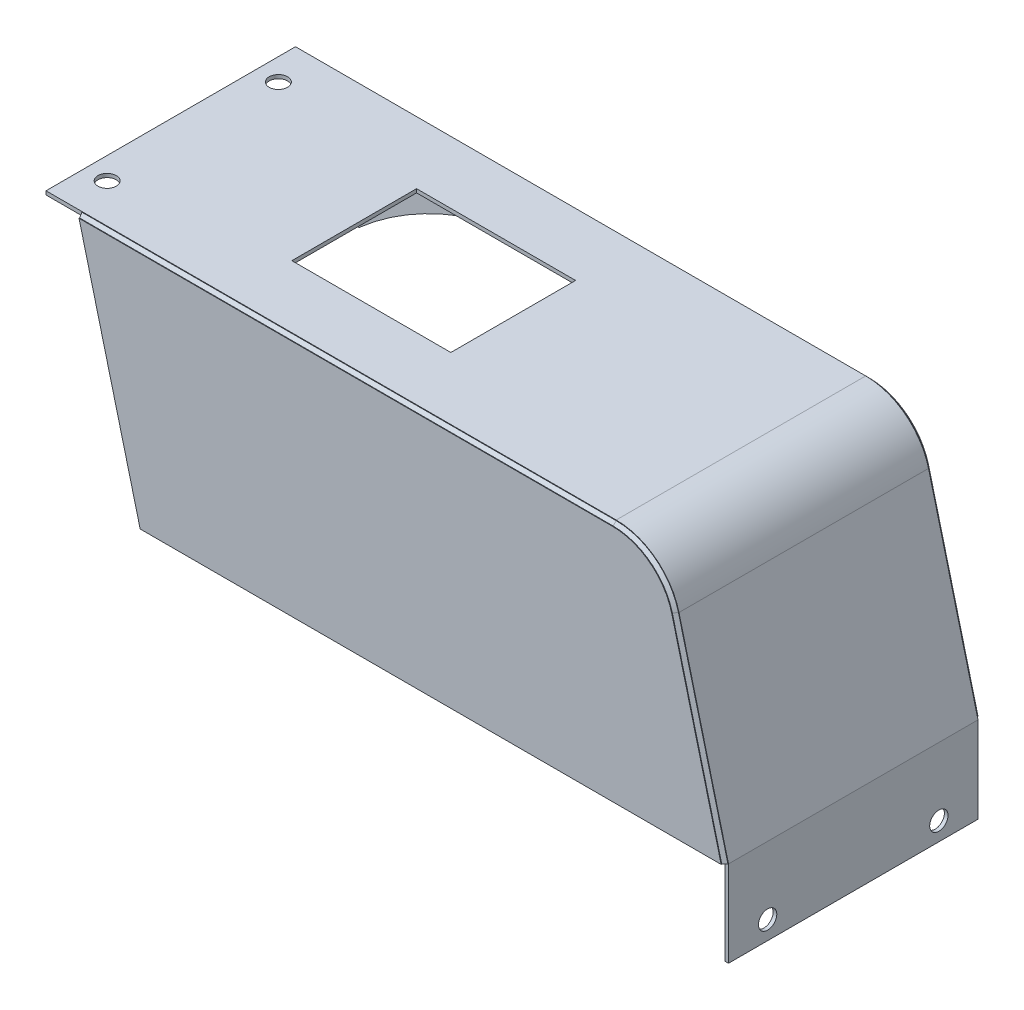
ISO-10303-21;
HEADER;
FILE_DESCRIPTION(('STEP AP214'),'2;1');
FILE_NAME('part.step','',(''),(''),'','','');
FILE_SCHEMA(('AUTOMOTIVE_DESIGN { 1 0 10303 214 1 1 1 1 }'));
ENDSEC;
DATA;
#1=APPLICATION_CONTEXT('core data for automotive mechanical design processes');
#2=APPLICATION_PROTOCOL_DEFINITION('international standard','automotive_design',2000,#1);
#3=PRODUCT_CONTEXT('',#1,'mechanical');
#4=PRODUCT('Part','Part','',(#3));
#5=PRODUCT_RELATED_PRODUCT_CATEGORY('part','',(#4));
#6=PRODUCT_DEFINITION_FORMATION('','',#4);
#7=PRODUCT_DEFINITION_CONTEXT('part definition',#1,'design');
#8=PRODUCT_DEFINITION('design','',#6,#7);
#9=PRODUCT_DEFINITION_SHAPE('','',#8);
#10=(LENGTH_UNIT() NAMED_UNIT(*) SI_UNIT(.MILLI.,.METRE.));
#11=(NAMED_UNIT(*) PLANE_ANGLE_UNIT() SI_UNIT($,.RADIAN.));
#12=(NAMED_UNIT(*) SI_UNIT($,.STERADIAN.) SOLID_ANGLE_UNIT());
#13=UNCERTAINTY_MEASURE_WITH_UNIT(LENGTH_MEASURE(1.E-05),#10,'distance_accuracy_value','');
#14=(GEOMETRIC_REPRESENTATION_CONTEXT(3) GLOBAL_UNCERTAINTY_ASSIGNED_CONTEXT((#13)) GLOBAL_UNIT_ASSIGNED_CONTEXT((#10,
#11,#12)) REPRESENTATION_CONTEXT('',''));
#15=CARTESIAN_POINT('',(0.,0.,0.));
#16=DIRECTION('',(0.,0.,1.));
#17=DIRECTION('',(1.,0.,0.));
#18=AXIS2_PLACEMENT_3D('',#15,#16,#17);
#19=CARTESIAN_POINT('',(-427.592846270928,52.5377980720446,207.));
#20=DIRECTION('',(0.968663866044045,0.248375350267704,0.));
#21=DIRECTION('',(-0.248375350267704,0.968663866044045,0.));
#22=AXIS2_PLACEMENT_3D('',#19,#20,#21);
#23=PLANE('',#22);
#24=DIRECTION('',(0.,0.,-1.));
#25=VECTOR('',#24,1.);
#26=CARTESIAN_POINT('',(-427.592846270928,52.5377980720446,207.));
#27=LINE('',#26,#25);
#28=CARTESIAN_POINT('',(-427.592846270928,52.5377980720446,206.5));
#29=VERTEX_POINT('',#28);
#30=CARTESIAN_POINT('',(-427.592846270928,52.5377980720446,204.));
#31=VERTEX_POINT('',#30);
#32=EDGE_CURVE('E95',#29,#31,#27,.T.);
#33=ORIENTED_EDGE('',*,*,#32,.F.);
#34=DIRECTION('',(0.178400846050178,-0.695763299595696,0.695763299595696));
#35=VECTOR('',#34,1.);
#36=CARTESIAN_POINT('',(-427.530783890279,52.2957547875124,206.742043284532));
#37=LINE('',#36,#35);
#38=CARTESIAN_POINT('',(-428.233871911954,55.0377980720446,204.));
#39=VERTEX_POINT('',#38);
#40=EDGE_CURVE('E12',#29,#39,#37,.F.);
#41=ORIENTED_EDGE('',*,*,#40,.T.);
#42=DIRECTION('',(-0.248375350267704,0.968663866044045,0.));
#43=VECTOR('',#42,1.);
#44=CARTESIAN_POINT('',(-427.592846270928,52.5377980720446,204.));
#45=LINE('',#44,#43);
#46=EDGE_CURVE('E107',#31,#39,#45,.T.);
#47=ORIENTED_EDGE('',*,*,#46,.F.);
#48=EDGE_LOOP('',(#33,#41,#47));
#49=FACE_BOUND('',#48,.T.);
#50=ADVANCED_FACE('F42',(#49),#23,.F.);
#51=CARTESIAN_POINT('',(97.4071537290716,-142.462201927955,207.));
#52=DIRECTION('',(0.,1.,0.));
#53=DIRECTION('',(-1.,0.,0.));
#54=AXIS2_PLACEMENT_3D('',#51,#52,#53);
#55=PLANE('',#54);
#56=DIRECTION('',(0.,0.,-1.));
#57=VECTOR('',#56,1.);
#58=CARTESIAN_POINT('',(97.4071537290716,-142.462201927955,207.));
#59=LINE('',#58,#57);
#60=CARTESIAN_POINT('',(97.4071537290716,-142.462201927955,206.5));
#61=VERTEX_POINT('',#60);
#62=CARTESIAN_POINT('',(97.4071537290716,-142.462201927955,204.));
#63=VERTEX_POINT('',#62);
#64=EDGE_CURVE('E57',#61,#63,#59,.T.);
#65=ORIENTED_EDGE('',*,*,#64,.T.);
#66=DIRECTION('',(-1.,0.,0.));
#67=VECTOR('',#66,1.);
#68=CARTESIAN_POINT('',(97.4071537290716,-142.462201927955,204.));
#69=LINE('',#68,#67);
#70=CARTESIAN_POINT('',(99.988028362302,-142.462201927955,204.));
#71=VERTEX_POINT('',#70);
#72=EDGE_CURVE('E124',#71,#63,#69,.T.);
#73=ORIENTED_EDGE('',*,*,#72,.F.);
#74=DIRECTION('',(0.718271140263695,0.,-0.695763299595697));
#75=VECTOR('',#74,1.);
#76=CARTESIAN_POINT('',(97.1572803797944,-142.462201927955,206.742043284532));
#77=LINE('',#76,#75);
#78=EDGE_CURVE('E50',#71,#61,#77,.F.);
#79=ORIENTED_EDGE('',*,*,#78,.T.);
#80=EDGE_LOOP('',(#65,#73,#79));
#81=FACE_BOUND('',#80,.T.);
#82=ADVANCED_FACE('F44',(#81),#55,.F.);
#83=CARTESIAN_POINT('',(-427.592846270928,52.5377980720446,206.5));
#84=DIRECTION('',(0.,0.707106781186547,0.707106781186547));
#85=DIRECTION('',(0.,-0.707106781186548,0.707106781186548));
#86=AXIS2_PLACEMENT_3D('',#83,#84,#85);
#87=PLANE('',#86);
#88=ORIENTED_EDGE('',*,*,#40,.F.);
#89=DIRECTION('',(-1.,0.,0.));
#90=VECTOR('',#89,1.);
#91=CARTESIAN_POINT('',(-427.592846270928,52.5377980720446,206.5));
#92=LINE('',#91,#90);
#93=CARTESIAN_POINT('',(8.61017388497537,52.5377980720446,206.5));
#94=VERTEX_POINT('',#93);
#95=EDGE_CURVE('E65',#94,#29,#92,.T.);
#96=ORIENTED_EDGE('',*,*,#95,.F.);
#97=DIRECTION('',(0.,-0.707106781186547,0.707106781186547));
#98=VECTOR('',#97,1.);
#99=CARTESIAN_POINT('',(8.61017388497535,55.0377980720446,204.));
#100=LINE('',#99,#98);
#101=CARTESIAN_POINT('',(8.61017388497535,55.0377980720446,204.));
#102=VERTEX_POINT('',#101);
#103=EDGE_CURVE('E139',#102,#94,#100,.T.);
#104=ORIENTED_EDGE('',*,*,#103,.F.);
#105=DIRECTION('',(1.,0.,0.));
#106=VECTOR('',#105,1.);
#107=CARTESIAN_POINT('',(8.61017388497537,55.0377980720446,204.));
#108=LINE('',#107,#106);
#109=EDGE_CURVE('E115',#39,#102,#108,.T.);
#110=ORIENTED_EDGE('',*,*,#109,.F.);
#111=EDGE_LOOP('',(#88,#96,#104,#110));
#112=FACE_BOUND('',#111,.T.);
#113=ADVANCED_FACE('F155',(#112),#87,.T.);
#114=CARTESIAN_POINT('',(8.61017388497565,2.53779807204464,206.5));
#115=DIRECTION('',(0.,0.,-1.));
#116=DIRECTION('',(-1.,0.,0.));
#117=AXIS2_PLACEMENT_3D('',#114,#115,#116);
#118=CONICAL_SURFACE('',#117,50.,0.785398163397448);
#119=ORIENTED_EDGE('',*,*,#103,.T.);
#120=CARTESIAN_POINT('',(8.61017388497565,2.53779807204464,206.5));
#121=DIRECTION('',(0.,0.,-1.));
#122=DIRECTION('',(-1.,0.,0.));
#123=AXIS2_PLACEMENT_3D('',#120,#121,#122);
#124=CIRCLE('',#123,50.);
#125=CARTESIAN_POINT('',(57.043367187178,14.9565655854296,206.5));
#126=VERTEX_POINT('',#125);
#127=EDGE_CURVE('E126',#126,#94,#124,.F.);
#128=ORIENTED_EDGE('',*,*,#127,.F.);
#129=DIRECTION('',(-0.68494878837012,-0.175627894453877,0.707106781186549));
#130=VECTOR('',#129,1.);
#131=CARTESIAN_POINT('',(59.4650268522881,15.5775039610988,204.));
#132=LINE('',#131,#130);
#133=CARTESIAN_POINT('',(59.4650268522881,15.5775039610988,204.));
#134=VERTEX_POINT('',#133);
#135=EDGE_CURVE('E111',#134,#126,#132,.T.);
#136=ORIENTED_EDGE('',*,*,#135,.F.);
#137=CARTESIAN_POINT('',(8.61017388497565,2.53779807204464,204.));
#138=DIRECTION('',(0.,0.,-1.));
#139=DIRECTION('',(-1.,0.,0.));
#140=AXIS2_PLACEMENT_3D('',#137,#138,#139);
#141=CIRCLE('',#140,52.5);
#142=EDGE_CURVE('E114',#102,#134,#141,.T.);
#143=ORIENTED_EDGE('',*,*,#142,.F.);
#144=EDGE_LOOP('',(#119,#128,#136,#143));
#145=FACE_BOUND('',#144,.T.);
#146=ADVANCED_FACE('F158',(#145),#118,.T.);
#147=CARTESIAN_POINT('',(57.043367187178,14.9565655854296,206.5));
#148=DIRECTION('',(0.684948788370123,0.175627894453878,0.707106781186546));
#149=DIRECTION('',(0.718271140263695,0.,-0.695763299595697));
#150=AXIS2_PLACEMENT_3D('',#147,#148,#149);
#151=PLANE('',#150);
#152=ORIENTED_EDGE('',*,*,#78,.F.);
#153=DIRECTION('',(0.248375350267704,-0.968663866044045,0.));
#154=VECTOR('',#153,1.);
#155=CARTESIAN_POINT('',(99.8288133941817,-141.841263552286,204.));
#156=LINE('',#155,#154);
#157=EDGE_CURVE('E117',#134,#71,#156,.T.);
#158=ORIENTED_EDGE('',*,*,#157,.F.);
#159=ORIENTED_EDGE('',*,*,#135,.T.);
#160=DIRECTION('',(-0.248375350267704,0.968663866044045,0.));
#161=VECTOR('',#160,1.);
#162=CARTESIAN_POINT('',(57.043367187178,14.9565655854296,206.5));
#163=LINE('',#162,#161);
#164=EDGE_CURVE('E119',#61,#126,#163,.T.);
#165=ORIENTED_EDGE('',*,*,#164,.F.);
#166=EDGE_LOOP('',(#152,#158,#159,#165));
#167=FACE_BOUND('',#166,.T.);
#168=ADVANCED_FACE('F135',(#167),#151,.T.);
#169=CARTESIAN_POINT('',(-427.592846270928,52.5377980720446,207.));
#170=DIRECTION('',(0.,-1.,0.));
#171=DIRECTION('',(1.,0.,0.));
#172=AXIS2_PLACEMENT_3D('',#169,#170,#171);
#173=PLANE('',#172);
#174=ORIENTED_EDGE('',*,*,#95,.T.);
#175=ORIENTED_EDGE('',*,*,#32,.T.);
#176=DIRECTION('',(-1.,0.,0.));
#177=VECTOR('',#176,1.);
#178=CARTESIAN_POINT('',(8.61017388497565,52.5377980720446,204.));
#179=LINE('',#178,#177);
#180=CARTESIAN_POINT('',(8.61017388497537,52.5377980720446,204.));
#181=VERTEX_POINT('',#180);
#182=EDGE_CURVE('E98',#181,#31,#179,.T.);
#183=ORIENTED_EDGE('',*,*,#182,.F.);
#184=DIRECTION('',(0.,0.,1.));
#185=VECTOR('',#184,1.);
#186=CARTESIAN_POINT('',(8.61017388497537,52.5377980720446,207.));
#187=LINE('',#186,#185);
#188=EDGE_CURVE('E103',#94,#181,#187,.F.);
#189=ORIENTED_EDGE('',*,*,#188,.F.);
#190=EDGE_LOOP('',(#174,#175,#183,#189));
#191=FACE_BOUND('',#190,.T.);
#192=ADVANCED_FACE('F97',(#191),#173,.T.);
#193=CARTESIAN_POINT('',(8.61017388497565,2.53779807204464,204.));
#194=DIRECTION('',(0.,0.,-1.));
#195=DIRECTION('',(-1.,0.,0.));
#196=AXIS2_PLACEMENT_3D('',#193,#194,#195);
#197=PLANE('',#196);
#198=ORIENTED_EDGE('',*,*,#46,.T.);
#199=ORIENTED_EDGE('',*,*,#109,.T.);
#200=ORIENTED_EDGE('',*,*,#142,.T.);
#201=ORIENTED_EDGE('',*,*,#157,.T.);
#202=ORIENTED_EDGE('',*,*,#72,.T.);
#203=DIRECTION('',(-0.248375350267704,0.968663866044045,0.));
#204=VECTOR('',#203,1.);
#205=CARTESIAN_POINT('',(57.0433671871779,14.9565655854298,204.));
#206=LINE('',#205,#204);
#207=CARTESIAN_POINT('',(57.043367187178,14.9565655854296,204.));
#208=VERTEX_POINT('',#207);
#209=EDGE_CURVE('E147',#63,#208,#206,.T.);
#210=ORIENTED_EDGE('',*,*,#209,.T.);
#211=CARTESIAN_POINT('',(8.61017388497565,2.53779807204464,204.));
#212=DIRECTION('',(0.,0.,-1.));
#213=DIRECTION('',(-1.,0.,0.));
#214=AXIS2_PLACEMENT_3D('',#211,#212,#213);
#215=CIRCLE('',#214,50.);
#216=EDGE_CURVE('E110',#208,#181,#215,.F.);
#217=ORIENTED_EDGE('',*,*,#216,.T.);
#218=ORIENTED_EDGE('',*,*,#182,.T.);
#219=EDGE_LOOP('',(#198,#199,#200,#201,#202,#210,#217,#218));
#220=FACE_BOUND('',#219,.T.);
#221=ADVANCED_FACE('F106',(#220),#197,.T.);
#222=CARTESIAN_POINT('',(8.61017388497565,2.53779807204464,207.));
#223=DIRECTION('',(0.,0.,-1.));
#224=DIRECTION('',(-1.,0.,0.));
#225=AXIS2_PLACEMENT_3D('',#222,#223,#224);
#226=CYLINDRICAL_SURFACE('',#225,50.);
#227=ORIENTED_EDGE('',*,*,#127,.T.);
#228=ORIENTED_EDGE('',*,*,#188,.T.);
#229=ORIENTED_EDGE('',*,*,#216,.F.);
#230=DIRECTION('',(0.,0.,-1.));
#231=VECTOR('',#230,1.);
#232=CARTESIAN_POINT('',(57.043367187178,14.9565655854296,207.));
#233=LINE('',#232,#231);
#234=EDGE_CURVE('E144',#126,#208,#233,.T.);
#235=ORIENTED_EDGE('',*,*,#234,.F.);
#236=EDGE_LOOP('',(#227,#228,#229,#235));
#237=FACE_BOUND('',#236,.T.);
#238=ADVANCED_FACE('F152',(#237),#226,.F.);
#239=CARTESIAN_POINT('',(57.043367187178,14.9565655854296,207.));
#240=DIRECTION('',(-0.968663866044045,-0.248375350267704,0.));
#241=DIRECTION('',(0.248375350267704,-0.968663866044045,0.));
#242=AXIS2_PLACEMENT_3D('',#239,#240,#241);
#243=PLANE('',#242);
#244=ORIENTED_EDGE('',*,*,#164,.T.);
#245=ORIENTED_EDGE('',*,*,#234,.T.);
#246=ORIENTED_EDGE('',*,*,#209,.F.);
#247=ORIENTED_EDGE('',*,*,#64,.F.);
#248=EDGE_LOOP('',(#244,#245,#246,#247));
#249=FACE_BOUND('',#248,.T.);
#250=ADVANCED_FACE('F150',(#249),#243,.T.);
#251=CLOSED_SHELL('',(#50,#82,#113,#146,#168,#192,#221,#238,#250));
#252=MANIFOLD_SOLID_BREP('B2',#251);
#253=CARTESIAN_POINT('',(97.4071537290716,-142.462201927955,-3.));
#254=DIRECTION('',(0.,1.,0.));
#255=DIRECTION('',(-1.,0.,0.));
#256=AXIS2_PLACEMENT_3D('',#253,#254,#255);
#257=PLANE('',#256);
#258=DIRECTION('',(0.,0.,1.));
#259=VECTOR('',#258,1.);
#260=CARTESIAN_POINT('',(97.4071537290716,-142.462201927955,-3.));
#261=LINE('',#260,#259);
#262=CARTESIAN_POINT('',(97.4071537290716,-142.462201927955,-2.49999999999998));
#263=VERTEX_POINT('',#262);
#264=CARTESIAN_POINT('',(97.4071537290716,-142.462201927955,0.));
#265=VERTEX_POINT('',#264);
#266=EDGE_CURVE('E295',#263,#265,#261,.T.);
#267=ORIENTED_EDGE('',*,*,#266,.F.);
#268=DIRECTION('',(0.718271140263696,0.,0.695763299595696));
#269=VECTOR('',#268,1.);
#270=CARTESIAN_POINT('',(97.1572803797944,-142.462201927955,-2.74204328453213));
#271=LINE('',#270,#269);
#272=CARTESIAN_POINT('',(99.988028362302,-142.462201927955,0.));
#273=VERTEX_POINT('',#272);
#274=EDGE_CURVE('E40',#263,#273,#271,.T.);
#275=ORIENTED_EDGE('',*,*,#274,.T.);
#276=DIRECTION('',(1.,0.,0.));
#277=VECTOR('',#276,1.);
#278=CARTESIAN_POINT('',(8.61017388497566,-142.462201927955,0.));
#279=LINE('',#278,#277);
#280=EDGE_CURVE('E307',#265,#273,#279,.T.);
#281=ORIENTED_EDGE('',*,*,#280,.F.);
#282=EDGE_LOOP('',(#267,#275,#281));
#283=FACE_BOUND('',#282,.T.);
#284=ADVANCED_FACE('F242',(#283),#257,.F.);
#285=CARTESIAN_POINT('',(-427.592846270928,52.5377980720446,-3.));
#286=DIRECTION('',(0.968663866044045,0.248375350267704,0.));
#287=DIRECTION('',(-0.248375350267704,0.968663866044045,0.));
#288=AXIS2_PLACEMENT_3D('',#285,#286,#287);
#289=PLANE('',#288);
#290=DIRECTION('',(0.,0.,1.));
#291=VECTOR('',#290,1.);
#292=CARTESIAN_POINT('',(-427.592846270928,52.5377980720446,-3.));
#293=LINE('',#292,#291);
#294=CARTESIAN_POINT('',(-427.592846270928,52.5377980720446,-2.49999999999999));
#295=VERTEX_POINT('',#294);
#296=CARTESIAN_POINT('',(-427.592846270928,52.5377980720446,0.));
#297=VERTEX_POINT('',#296);
#298=EDGE_CURVE('E257',#295,#297,#293,.T.);
#299=ORIENTED_EDGE('',*,*,#298,.T.);
#300=DIRECTION('',(0.248375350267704,-0.968663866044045,0.));
#301=VECTOR('',#300,1.);
#302=CARTESIAN_POINT('',(-388.653733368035,-99.32474224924,0.));
#303=LINE('',#302,#301);
#304=CARTESIAN_POINT('',(-428.233871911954,55.0377980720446,0.));
#305=VERTEX_POINT('',#304);
#306=EDGE_CURVE('E323',#305,#297,#303,.T.);
#307=ORIENTED_EDGE('',*,*,#306,.F.);
#308=DIRECTION('',(0.178400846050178,-0.695763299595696,-0.695763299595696));
#309=VECTOR('',#308,1.);
#310=CARTESIAN_POINT('',(-427.530783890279,52.2957547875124,-2.74204328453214));
#311=LINE('',#310,#309);
#312=EDGE_CURVE('E250',#305,#295,#311,.T.);
#313=ORIENTED_EDGE('',*,*,#312,.T.);
#314=EDGE_LOOP('',(#299,#307,#313));
#315=FACE_BOUND('',#314,.T.);
#316=ADVANCED_FACE('F244',(#315),#289,.F.);
#317=CARTESIAN_POINT('',(59.465026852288,15.5775039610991,0.));
#318=DIRECTION('',(-0.684948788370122,-0.175627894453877,0.707106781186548));
#319=DIRECTION('',(0.718271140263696,0.,0.695763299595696));
#320=AXIS2_PLACEMENT_3D('',#317,#318,#319);
#321=PLANE('',#320);
#322=ORIENTED_EDGE('',*,*,#274,.F.);
#323=DIRECTION('',(0.248375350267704,-0.968663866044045,0.));
#324=VECTOR('',#323,1.);
#325=CARTESIAN_POINT('',(97.4071537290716,-142.462201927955,-2.49999999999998));
#326=LINE('',#325,#324);
#327=CARTESIAN_POINT('',(57.0433671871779,14.9565655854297,-2.49999999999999));
#328=VERTEX_POINT('',#327);
#329=EDGE_CURVE('E265',#328,#263,#326,.T.);
#330=ORIENTED_EDGE('',*,*,#329,.F.);
#331=DIRECTION('',(-0.684948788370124,-0.175627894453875,-0.707106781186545));
#332=VECTOR('',#331,1.);
#333=CARTESIAN_POINT('',(59.465026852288,15.5775039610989,0.));
#334=LINE('',#333,#332);
#335=CARTESIAN_POINT('',(59.465026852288,15.5775039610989,0.));
#336=VERTEX_POINT('',#335);
#337=EDGE_CURVE('E318',#336,#328,#334,.T.);
#338=ORIENTED_EDGE('',*,*,#337,.F.);
#339=DIRECTION('',(-0.248375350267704,0.968663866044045,0.));
#340=VECTOR('',#339,1.);
#341=CARTESIAN_POINT('',(59.465026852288,15.5775039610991,0.));
#342=LINE('',#341,#340);
#343=EDGE_CURVE('E314',#273,#336,#342,.T.);
#344=ORIENTED_EDGE('',*,*,#343,.F.);
#345=EDGE_LOOP('',(#322,#330,#338,#344));
#346=FACE_BOUND('',#345,.T.);
#347=ADVANCED_FACE('F358',(#346),#321,.F.);
#348=CARTESIAN_POINT('',(8.61017388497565,2.53779807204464,0.));
#349=DIRECTION('',(0.,0.,1.));
#350=DIRECTION('',(1.,0.,0.));
#351=AXIS2_PLACEMENT_3D('',#348,#349,#350);
#352=CONICAL_SURFACE('',#351,52.5,0.785398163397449);
#353=ORIENTED_EDGE('',*,*,#337,.T.);
#354=CARTESIAN_POINT('',(8.61017388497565,2.53779807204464,-2.49999999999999));
#355=DIRECTION('',(0.,0.,-1.));
#356=DIRECTION('',(-1.,0.,0.));
#357=AXIS2_PLACEMENT_3D('',#354,#355,#356);
#358=CIRCLE('',#357,50.);
#359=CARTESIAN_POINT('',(8.61017388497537,52.5377980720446,-2.5));
#360=VERTEX_POINT('',#359);
#361=EDGE_CURVE('E327',#360,#328,#358,.T.);
#362=ORIENTED_EDGE('',*,*,#361,.F.);
#363=DIRECTION('',(0.,-0.707106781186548,-0.707106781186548));
#364=VECTOR('',#363,1.);
#365=CARTESIAN_POINT('',(8.61017388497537,55.0377980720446,0.));
#366=LINE('',#365,#364);
#367=CARTESIAN_POINT('',(8.61017388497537,55.0377980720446,0.));
#368=VERTEX_POINT('',#367);
#369=EDGE_CURVE('E338',#368,#360,#366,.T.);
#370=ORIENTED_EDGE('',*,*,#369,.F.);
#371=CARTESIAN_POINT('',(8.61017388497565,2.53779807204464,0.));
#372=DIRECTION('',(0.,0.,-1.));
#373=DIRECTION('',(-1.,0.,0.));
#374=AXIS2_PLACEMENT_3D('',#371,#372,#373);
#375=CIRCLE('',#374,52.5);
#376=EDGE_CURVE('E313',#336,#368,#375,.F.);
#377=ORIENTED_EDGE('',*,*,#376,.F.);
#378=EDGE_LOOP('',(#353,#362,#370,#377));
#379=FACE_BOUND('',#378,.T.);
#380=ADVANCED_FACE('F348',(#379),#352,.T.);
#381=CARTESIAN_POINT('',(8.61017388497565,55.0377980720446,0.));
#382=DIRECTION('',(0.,-0.707106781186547,0.707106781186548));
#383=DIRECTION('',(0.,-0.707106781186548,-0.707106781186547));
#384=AXIS2_PLACEMENT_3D('',#381,#382,#383);
#385=PLANE('',#384);
#386=ORIENTED_EDGE('',*,*,#369,.T.);
#387=DIRECTION('',(1.,0.,0.));
#388=VECTOR('',#387,1.);
#389=CARTESIAN_POINT('',(8.61017388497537,52.5377980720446,-2.49999999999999));
#390=LINE('',#389,#388);
#391=EDGE_CURVE('E325',#295,#360,#390,.T.);
#392=ORIENTED_EDGE('',*,*,#391,.F.);
#393=ORIENTED_EDGE('',*,*,#312,.F.);
#394=DIRECTION('',(-1.,0.,0.));
#395=VECTOR('',#394,1.);
#396=CARTESIAN_POINT('',(8.61017388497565,55.0377980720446,0.));
#397=LINE('',#396,#395);
#398=EDGE_CURVE('E316',#368,#305,#397,.T.);
#399=ORIENTED_EDGE('',*,*,#398,.F.);
#400=EDGE_LOOP('',(#386,#392,#393,#399));
#401=FACE_BOUND('',#400,.T.);
#402=ADVANCED_FACE('F336',(#401),#385,.F.);
#403=CARTESIAN_POINT('',(97.4071537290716,-142.462201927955,-3.));
#404=DIRECTION('',(-0.968663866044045,-0.248375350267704,0.));
#405=DIRECTION('',(0.248375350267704,-0.968663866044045,0.));
#406=AXIS2_PLACEMENT_3D('',#403,#404,#405);
#407=PLANE('',#406);
#408=ORIENTED_EDGE('',*,*,#329,.T.);
#409=ORIENTED_EDGE('',*,*,#266,.T.);
#410=DIRECTION('',(-0.248375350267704,0.968663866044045,0.));
#411=VECTOR('',#410,1.);
#412=CARTESIAN_POINT('',(57.0433671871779,14.9565655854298,0.));
#413=LINE('',#412,#411);
#414=CARTESIAN_POINT('',(57.0433671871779,14.9565655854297,0.));
#415=VERTEX_POINT('',#414);
#416=EDGE_CURVE('E298',#265,#415,#413,.T.);
#417=ORIENTED_EDGE('',*,*,#416,.T.);
#418=DIRECTION('',(0.,0.,1.));
#419=VECTOR('',#418,1.);
#420=CARTESIAN_POINT('',(57.0433671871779,14.9565655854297,-3.));
#421=LINE('',#420,#419);
#422=EDGE_CURVE('E302',#328,#415,#421,.T.);
#423=ORIENTED_EDGE('',*,*,#422,.F.);
#424=EDGE_LOOP('',(#408,#409,#417,#423));
#425=FACE_BOUND('',#424,.T.);
#426=ADVANCED_FACE('F297',(#425),#407,.T.);
#427=CARTESIAN_POINT('',(8.61017388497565,2.53779807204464,0.));
#428=DIRECTION('',(0.,0.,-1.));
#429=DIRECTION('',(-1.,0.,0.));
#430=AXIS2_PLACEMENT_3D('',#427,#428,#429);
#431=PLANE('',#430);
#432=ORIENTED_EDGE('',*,*,#343,.T.);
#433=ORIENTED_EDGE('',*,*,#376,.T.);
#434=ORIENTED_EDGE('',*,*,#398,.T.);
#435=ORIENTED_EDGE('',*,*,#306,.T.);
#436=DIRECTION('',(-1.,0.,0.));
#437=VECTOR('',#436,1.);
#438=CARTESIAN_POINT('',(8.61017388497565,52.5377980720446,0.));
#439=LINE('',#438,#437);
#440=CARTESIAN_POINT('',(8.61017388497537,52.5377980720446,0.));
#441=VERTEX_POINT('',#440);
#442=EDGE_CURVE('E352',#441,#297,#439,.T.);
#443=ORIENTED_EDGE('',*,*,#442,.F.);
#444=CARTESIAN_POINT('',(8.61017388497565,2.53779807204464,0.));
#445=DIRECTION('',(0.,0.,-1.));
#446=DIRECTION('',(-1.,0.,0.));
#447=AXIS2_PLACEMENT_3D('',#444,#445,#446);
#448=CIRCLE('',#447,50.);
#449=EDGE_CURVE('E310',#415,#441,#448,.F.);
#450=ORIENTED_EDGE('',*,*,#449,.F.);
#451=ORIENTED_EDGE('',*,*,#416,.F.);
#452=ORIENTED_EDGE('',*,*,#280,.T.);
#453=EDGE_LOOP('',(#432,#433,#434,#435,#443,#450,#451,#452));
#454=FACE_BOUND('',#453,.T.);
#455=ADVANCED_FACE('F306',(#454),#431,.F.);
#456=CARTESIAN_POINT('',(8.61017388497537,52.5377980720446,-3.));
#457=DIRECTION('',(0.,-1.,0.));
#458=DIRECTION('',(1.,0.,0.));
#459=AXIS2_PLACEMENT_3D('',#456,#457,#458);
#460=PLANE('',#459);
#461=ORIENTED_EDGE('',*,*,#391,.T.);
#462=DIRECTION('',(0.,0.,1.));
#463=VECTOR('',#462,1.);
#464=CARTESIAN_POINT('',(8.61017388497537,52.5377980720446,-3.));
#465=LINE('',#464,#463);
#466=EDGE_CURVE('E341',#360,#441,#465,.T.);
#467=ORIENTED_EDGE('',*,*,#466,.T.);
#468=ORIENTED_EDGE('',*,*,#442,.T.);
#469=ORIENTED_EDGE('',*,*,#298,.F.);
#470=EDGE_LOOP('',(#461,#467,#468,#469));
#471=FACE_BOUND('',#470,.T.);
#472=ADVANCED_FACE('F340',(#471),#460,.T.);
#473=CARTESIAN_POINT('',(8.61017388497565,2.53779807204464,-3.));
#474=DIRECTION('',(0.,0.,1.));
#475=DIRECTION('',(1.,0.,0.));
#476=AXIS2_PLACEMENT_3D('',#473,#474,#475);
#477=CYLINDRICAL_SURFACE('',#476,50.);
#478=ORIENTED_EDGE('',*,*,#361,.T.);
#479=ORIENTED_EDGE('',*,*,#422,.T.);
#480=ORIENTED_EDGE('',*,*,#449,.T.);
#481=ORIENTED_EDGE('',*,*,#466,.F.);
#482=EDGE_LOOP('',(#478,#479,#480,#481));
#483=FACE_BOUND('',#482,.T.);
#484=ADVANCED_FACE('F344',(#483),#477,.F.);
#485=CLOSED_SHELL('',(#284,#316,#347,#380,#402,#426,#455,#472,#484));
#486=MANIFOLD_SOLID_BREP('B6',#485);
#487=CARTESIAN_POINT('',(97.4071537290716,-142.462201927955,-3.));
#488=DIRECTION('',(0.,1.,0.));
#489=DIRECTION('',(-1.,0.,0.));
#490=AXIS2_PLACEMENT_3D('',#487,#488,#489);
#491=PLANE('',#490);
#492=DIRECTION('',(-1.,0.,0.));
#493=VECTOR('',#492,1.);
#494=CARTESIAN_POINT('',(97.4071537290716,-142.462201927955,3.));
#495=LINE('',#494,#493);
#496=CARTESIAN_POINT('',(97.4071537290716,-142.462201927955,3.));
#497=VERTEX_POINT('',#496);
#498=CARTESIAN_POINT('',(17.8149775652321,-142.462201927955,3.));
#499=VERTEX_POINT('',#498);
#500=EDGE_CURVE('E540',#497,#499,#495,.T.);
#501=ORIENTED_EDGE('',*,*,#500,.T.);
#502=DIRECTION('',(0.,0.,-1.));
#503=VECTOR('',#502,1.);
#504=CARTESIAN_POINT('',(17.8149775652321,-142.462201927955,7.));
#505=LINE('',#504,#503);
#506=CARTESIAN_POINT('',(17.8149775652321,-142.462201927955,-3.));
#507=VERTEX_POINT('',#506);
#508=EDGE_CURVE('E456',#499,#507,#505,.T.);
#509=ORIENTED_EDGE('',*,*,#508,.T.);
#510=DIRECTION('',(-1.,0.,0.));
#511=VECTOR('',#510,1.);
#512=CARTESIAN_POINT('',(97.4071537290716,-142.462201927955,-3.));
#513=LINE('',#512,#511);
#514=CARTESIAN_POINT('',(97.4071537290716,-142.462201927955,-3.));
#515=VERTEX_POINT('',#514);
#516=EDGE_CURVE('E504',#515,#507,#513,.T.);
#517=ORIENTED_EDGE('',*,*,#516,.F.);
#518=DIRECTION('',(0.,0.,1.));
#519=VECTOR('',#518,1.);
#520=CARTESIAN_POINT('',(97.4071537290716,-142.462201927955,-3.));
#521=LINE('',#520,#519);
#522=EDGE_CURVE('E519',#515,#497,#521,.T.);
#523=ORIENTED_EDGE('',*,*,#522,.T.);
#524=EDGE_LOOP('',(#501,#509,#517,#523));
#525=FACE_BOUND('',#524,.T.);
#526=ADVANCED_FACE('F442',(#525),#491,.F.);
#527=CARTESIAN_POINT('',(-427.592846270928,52.5377980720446,-3.));
#528=DIRECTION('',(0.968663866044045,0.248375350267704,0.));
#529=DIRECTION('',(-0.248375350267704,0.968663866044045,0.));
#530=AXIS2_PLACEMENT_3D('',#527,#528,#529);
#531=PLANE('',#530);
#532=DIRECTION('',(-0.248375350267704,0.968663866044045,0.));
#533=VECTOR('',#532,1.);
#534=CARTESIAN_POINT('',(-427.592846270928,52.5377980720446,-3.));
#535=LINE('',#534,#533);
#536=CARTESIAN_POINT('',(-402.906075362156,-43.7406084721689,-3.));
#537=VERTEX_POINT('',#536);
#538=CARTESIAN_POINT('',(-427.592846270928,52.5377980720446,-3.));
#539=VERTEX_POINT('',#538);
#540=EDGE_CURVE('E501',#537,#539,#535,.T.);
#541=ORIENTED_EDGE('',*,*,#540,.F.);
#542=DIRECTION('',(0.,0.,-1.));
#543=VECTOR('',#542,1.);
#544=CARTESIAN_POINT('',(-402.906075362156,-43.7406084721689,7.));
#545=LINE('',#544,#543);
#546=CARTESIAN_POINT('',(-402.906075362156,-43.7406084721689,3.));
#547=VERTEX_POINT('',#546);
#548=EDGE_CURVE('E492',#537,#547,#545,.F.);
#549=ORIENTED_EDGE('',*,*,#548,.T.);
#550=DIRECTION('',(-0.248375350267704,0.968663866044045,0.));
#551=VECTOR('',#550,1.);
#552=CARTESIAN_POINT('',(-427.592846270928,52.5377980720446,3.));
#553=LINE('',#552,#551);
#554=CARTESIAN_POINT('',(-427.592846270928,52.5377980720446,3.));
#555=VERTEX_POINT('',#554);
#556=EDGE_CURVE('E535',#547,#555,#553,.T.);
#557=ORIENTED_EDGE('',*,*,#556,.T.);
#558=DIRECTION('',(0.,0.,1.));
#559=VECTOR('',#558,1.);
#560=CARTESIAN_POINT('',(-427.592846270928,52.5377980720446,-3.));
#561=LINE('',#560,#559);
#562=EDGE_CURVE('E449',#539,#555,#561,.T.);
#563=ORIENTED_EDGE('',*,*,#562,.F.);
#564=EDGE_LOOP('',(#541,#549,#557,#563));
#565=FACE_BOUND('',#564,.T.);
#566=ADVANCED_FACE('F506',(#565),#531,.F.);
#567=CARTESIAN_POINT('',(8.61017388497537,52.5377980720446,-3.));
#568=DIRECTION('',(0.,-1.,0.));
#569=DIRECTION('',(1.,0.,0.));
#570=AXIS2_PLACEMENT_3D('',#567,#568,#569);
#571=PLANE('',#570);
#572=DIRECTION('',(1.,0.,0.));
#573=VECTOR('',#572,1.);
#574=CARTESIAN_POINT('',(8.61017388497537,52.5377980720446,3.));
#575=LINE('',#574,#573);
#576=CARTESIAN_POINT('',(8.61017388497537,52.5377980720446,3.));
#577=VERTEX_POINT('',#576);
#578=EDGE_CURVE('E531',#555,#577,#575,.T.);
#579=ORIENTED_EDGE('',*,*,#578,.T.);
#580=DIRECTION('',(0.,0.,1.));
#581=VECTOR('',#580,1.);
#582=CARTESIAN_POINT('',(8.61017388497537,52.5377980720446,-3.));
#583=LINE('',#582,#581);
#584=CARTESIAN_POINT('',(8.61017388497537,52.5377980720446,-3.));
#585=VERTEX_POINT('',#584);
#586=EDGE_CURVE('E525',#585,#577,#583,.T.);
#587=ORIENTED_EDGE('',*,*,#586,.F.);
#588=DIRECTION('',(1.,0.,0.));
#589=VECTOR('',#588,1.);
#590=CARTESIAN_POINT('',(8.61017388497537,52.5377980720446,-3.));
#591=LINE('',#590,#589);
#592=EDGE_CURVE('E509',#539,#585,#591,.T.);
#593=ORIENTED_EDGE('',*,*,#592,.F.);
#594=ORIENTED_EDGE('',*,*,#562,.T.);
#595=EDGE_LOOP('',(#579,#587,#593,#594));
#596=FACE_BOUND('',#595,.T.);
#597=ADVANCED_FACE('F529',(#596),#571,.F.);
#598=CARTESIAN_POINT('',(8.61017388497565,2.53779807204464,-3.));
#599=DIRECTION('',(0.,0.,1.));
#600=DIRECTION('',(1.,0.,0.));
#601=AXIS2_PLACEMENT_3D('',#598,#599,#600);
#602=CYLINDRICAL_SURFACE('',#601,50.);
#603=CARTESIAN_POINT('',(8.61017388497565,2.53779807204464,3.));
#604=DIRECTION('',(0.,0.,-1.));
#605=DIRECTION('',(-1.,0.,0.));
#606=AXIS2_PLACEMENT_3D('',#603,#604,#605);
#607=CIRCLE('',#606,50.);
#608=CARTESIAN_POINT('',(57.043367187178,14.9565655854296,3.));
#609=VERTEX_POINT('',#608);
#610=EDGE_CURVE('E537',#577,#609,#607,.T.);
#611=ORIENTED_EDGE('',*,*,#610,.T.);
#612=DIRECTION('',(0.,0.,1.));
#613=VECTOR('',#612,1.);
#614=CARTESIAN_POINT('',(57.043367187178,14.9565655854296,-3.));
#615=LINE('',#614,#613);
#616=CARTESIAN_POINT('',(57.043367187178,14.9565655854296,-3.));
#617=VERTEX_POINT('',#616);
#618=EDGE_CURVE('E522',#617,#609,#615,.T.);
#619=ORIENTED_EDGE('',*,*,#618,.F.);
#620=CARTESIAN_POINT('',(8.61017388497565,2.53779807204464,-3.));
#621=DIRECTION('',(0.,0.,-1.));
#622=DIRECTION('',(-1.,0.,0.));
#623=AXIS2_PLACEMENT_3D('',#620,#621,#622);
#624=CIRCLE('',#623,50.);
#625=EDGE_CURVE('E511',#585,#617,#624,.T.);
#626=ORIENTED_EDGE('',*,*,#625,.F.);
#627=ORIENTED_EDGE('',*,*,#586,.T.);
#628=EDGE_LOOP('',(#611,#619,#626,#627));
#629=FACE_BOUND('',#628,.T.);
#630=ADVANCED_FACE('F557',(#629),#602,.T.);
#631=CARTESIAN_POINT('',(97.4071537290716,-142.462201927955,-3.));
#632=DIRECTION('',(-0.968663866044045,-0.248375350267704,0.));
#633=DIRECTION('',(0.248375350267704,-0.968663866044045,0.));
#634=AXIS2_PLACEMENT_3D('',#631,#632,#633);
#635=PLANE('',#634);
#636=DIRECTION('',(0.248375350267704,-0.968663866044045,0.));
#637=VECTOR('',#636,1.);
#638=CARTESIAN_POINT('',(97.4071537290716,-142.462201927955,3.));
#639=LINE('',#638,#637);
#640=EDGE_CURVE('E513',#609,#497,#639,.T.);
#641=ORIENTED_EDGE('',*,*,#640,.T.);
#642=ORIENTED_EDGE('',*,*,#522,.F.);
#643=DIRECTION('',(0.248375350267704,-0.968663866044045,0.));
#644=VECTOR('',#643,1.);
#645=CARTESIAN_POINT('',(97.4071537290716,-142.462201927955,-3.));
#646=LINE('',#645,#644);
#647=EDGE_CURVE('E463',#617,#515,#646,.T.);
#648=ORIENTED_EDGE('',*,*,#647,.F.);
#649=ORIENTED_EDGE('',*,*,#618,.T.);
#650=EDGE_LOOP('',(#641,#642,#648,#649));
#651=FACE_BOUND('',#650,.T.);
#652=ADVANCED_FACE('F544',(#651),#635,.F.);
#653=CARTESIAN_POINT('',(8.61017388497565,2.53779807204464,-3.));
#654=DIRECTION('',(0.,0.,-1.));
#655=DIRECTION('',(-1.,0.,0.));
#656=AXIS2_PLACEMENT_3D('',#653,#654,#655);
#657=PLANE('',#656);
#658=CARTESIAN_POINT('',(-227.592846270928,-242.462201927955,-3.));
#659=DIRECTION('',(0.,0.,-1.));
#660=DIRECTION('',(-1.,0.,0.));
#661=AXIS2_PLACEMENT_3D('',#658,#659,#660);
#662=CIRCLE('',#661,265.);
#663=EDGE_CURVE('E495',#537,#507,#662,.T.);
#664=ORIENTED_EDGE('',*,*,#663,.F.);
#665=ORIENTED_EDGE('',*,*,#540,.T.);
#666=ORIENTED_EDGE('',*,*,#592,.T.);
#667=ORIENTED_EDGE('',*,*,#625,.T.);
#668=ORIENTED_EDGE('',*,*,#647,.T.);
#669=ORIENTED_EDGE('',*,*,#516,.T.);
#670=EDGE_LOOP('',(#664,#665,#666,#667,#668,#669));
#671=FACE_BOUND('',#670,.T.);
#672=ADVANCED_FACE('F500',(#671),#657,.T.);
#673=CARTESIAN_POINT('',(8.61017388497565,2.53779807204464,3.));
#674=DIRECTION('',(0.,0.,-1.));
#675=DIRECTION('',(-1.,0.,0.));
#676=AXIS2_PLACEMENT_3D('',#673,#674,#675);
#677=PLANE('',#676);
#678=ORIENTED_EDGE('',*,*,#556,.F.);
#679=CARTESIAN_POINT('',(-227.592846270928,-242.462201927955,3.));
#680=DIRECTION('',(0.,0.,-1.));
#681=DIRECTION('',(-1.,0.,0.));
#682=AXIS2_PLACEMENT_3D('',#679,#680,#681);
#683=CIRCLE('',#682,265.);
#684=EDGE_CURVE('E240',#547,#499,#683,.T.);
#685=ORIENTED_EDGE('',*,*,#684,.T.);
#686=ORIENTED_EDGE('',*,*,#500,.F.);
#687=ORIENTED_EDGE('',*,*,#640,.F.);
#688=ORIENTED_EDGE('',*,*,#610,.F.);
#689=ORIENTED_EDGE('',*,*,#578,.F.);
#690=EDGE_LOOP('',(#678,#685,#686,#687,#688,#689));
#691=FACE_BOUND('',#690,.T.);
#692=ADVANCED_FACE('F534',(#691),#677,.F.);
#693=CARTESIAN_POINT('',(-227.592846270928,-242.462201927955,7.));
#694=DIRECTION('',(0.,0.,-1.));
#695=DIRECTION('',(-1.,0.,0.));
#696=AXIS2_PLACEMENT_3D('',#693,#694,#695);
#697=CYLINDRICAL_SURFACE('',#696,265.);
#698=ORIENTED_EDGE('',*,*,#684,.F.);
#699=ORIENTED_EDGE('',*,*,#548,.F.);
#700=ORIENTED_EDGE('',*,*,#663,.T.);
#701=ORIENTED_EDGE('',*,*,#508,.F.);
#702=EDGE_LOOP('',(#698,#699,#700,#701));
#703=FACE_BOUND('',#702,.T.);
#704=ADVANCED_FACE('F494',(#703),#697,.F.);
#705=CLOSED_SHELL('',(#526,#566,#597,#630,#652,#672,#692,#704));
#706=MANIFOLD_SOLID_BREP('B34',#705);
#707=CARTESIAN_POINT('',(8.61017388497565,2.53779807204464,207.));
#708=DIRECTION('',(0.,0.,-1.));
#709=DIRECTION('',(-1.,0.,0.));
#710=AXIS2_PLACEMENT_3D('',#707,#708,#709);
#711=CYLINDRICAL_SURFACE('',#710,50.);
#712=CARTESIAN_POINT('',(8.61017388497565,2.53779807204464,201.));
#713=DIRECTION('',(0.,0.,1.));
#714=DIRECTION('',(1.,0.,0.));
#715=AXIS2_PLACEMENT_3D('',#712,#713,#714);
#716=CIRCLE('',#715,50.);
#717=CARTESIAN_POINT('',(57.043367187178,14.9565655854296,201.));
#718=VERTEX_POINT('',#717);
#719=CARTESIAN_POINT('',(8.61017388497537,52.5377980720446,201.));
#720=VERTEX_POINT('',#719);
#721=EDGE_CURVE('E677',#718,#720,#716,.T.);
#722=ORIENTED_EDGE('',*,*,#721,.T.);
#723=DIRECTION('',(0.,0.,-1.));
#724=VECTOR('',#723,1.);
#725=CARTESIAN_POINT('',(8.61017388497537,52.5377980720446,207.));
#726=LINE('',#725,#724);
#727=CARTESIAN_POINT('',(8.61017388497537,52.5377980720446,207.));
#728=VERTEX_POINT('',#727);
#729=EDGE_CURVE('E440',#728,#720,#726,.T.);
#730=ORIENTED_EDGE('',*,*,#729,.F.);
#731=CARTESIAN_POINT('',(8.61017388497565,2.53779807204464,207.));
#732=DIRECTION('',(0.,0.,1.));
#733=DIRECTION('',(1.,0.,0.));
#734=AXIS2_PLACEMENT_3D('',#731,#732,#733);
#735=CIRCLE('',#734,50.);
#736=CARTESIAN_POINT('',(57.043367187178,14.9565655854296,207.));
#737=VERTEX_POINT('',#736);
#738=EDGE_CURVE('E698',#737,#728,#735,.T.);
#739=ORIENTED_EDGE('',*,*,#738,.F.);
#740=DIRECTION('',(0.,0.,-1.));
#741=VECTOR('',#740,1.);
#742=CARTESIAN_POINT('',(57.043367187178,14.9565655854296,207.));
#743=LINE('',#742,#741);
#744=EDGE_CURVE('E690',#737,#718,#743,.T.);
#745=ORIENTED_EDGE('',*,*,#744,.T.);
#746=EDGE_LOOP('',(#722,#730,#739,#745));
#747=FACE_BOUND('',#746,.T.);
#748=ADVANCED_FACE('F627',(#747),#711,.T.);
#749=CARTESIAN_POINT('',(-427.592846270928,52.5377980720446,207.));
#750=DIRECTION('',(0.,-1.,0.));
#751=DIRECTION('',(1.,0.,0.));
#752=AXIS2_PLACEMENT_3D('',#749,#750,#751);
#753=PLANE('',#752);
#754=DIRECTION('',(-1.,0.,0.));
#755=VECTOR('',#754,1.);
#756=CARTESIAN_POINT('',(-427.592846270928,52.5377980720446,201.));
#757=LINE('',#756,#755);
#758=CARTESIAN_POINT('',(-427.592846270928,52.5377980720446,201.));
#759=VERTEX_POINT('',#758);
#760=EDGE_CURVE('E673',#720,#759,#757,.T.);
#761=ORIENTED_EDGE('',*,*,#760,.T.);
#762=DIRECTION('',(0.,0.,-1.));
#763=VECTOR('',#762,1.);
#764=CARTESIAN_POINT('',(-427.592846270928,52.5377980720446,207.));
#765=LINE('',#764,#763);
#766=CARTESIAN_POINT('',(-427.592846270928,52.5377980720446,207.));
#767=VERTEX_POINT('',#766);
#768=EDGE_CURVE('E634',#767,#759,#765,.T.);
#769=ORIENTED_EDGE('',*,*,#768,.F.);
#770=DIRECTION('',(-1.,0.,0.));
#771=VECTOR('',#770,1.);
#772=CARTESIAN_POINT('',(-427.592846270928,52.5377980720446,207.));
#773=LINE('',#772,#771);
#774=EDGE_CURVE('E686',#728,#767,#773,.T.);
#775=ORIENTED_EDGE('',*,*,#774,.F.);
#776=ORIENTED_EDGE('',*,*,#729,.T.);
#777=EDGE_LOOP('',(#761,#769,#775,#776));
#778=FACE_BOUND('',#777,.T.);
#779=ADVANCED_FACE('F685',(#778),#753,.F.);
#780=CARTESIAN_POINT('',(-427.592846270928,52.5377980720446,207.));
#781=DIRECTION('',(0.968663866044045,0.248375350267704,0.));
#782=DIRECTION('',(-0.248375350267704,0.968663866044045,0.));
#783=AXIS2_PLACEMENT_3D('',#780,#781,#782);
#784=PLANE('',#783);
#785=DIRECTION('',(0.248375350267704,-0.968663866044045,0.));
#786=VECTOR('',#785,1.);
#787=CARTESIAN_POINT('',(-427.592846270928,52.5377980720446,201.));
#788=LINE('',#787,#786);
#789=CARTESIAN_POINT('',(-377.592846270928,-142.462201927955,201.));
#790=VERTEX_POINT('',#789);
#791=EDGE_CURVE('E679',#759,#790,#788,.T.);
#792=ORIENTED_EDGE('',*,*,#791,.T.);
#793=DIRECTION('',(0.,0.,-1.));
#794=VECTOR('',#793,1.);
#795=CARTESIAN_POINT('',(-377.592846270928,-142.462201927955,207.));
#796=LINE('',#795,#794);
#797=CARTESIAN_POINT('',(-377.592846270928,-142.462201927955,207.));
#798=VERTEX_POINT('',#797);
#799=EDGE_CURVE('E709',#798,#790,#796,.T.);
#800=ORIENTED_EDGE('',*,*,#799,.F.);
#801=DIRECTION('',(0.248375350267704,-0.968663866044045,0.));
#802=VECTOR('',#801,1.);
#803=CARTESIAN_POINT('',(-427.592846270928,52.5377980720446,207.));
#804=LINE('',#803,#802);
#805=EDGE_CURVE('E701',#767,#798,#804,.T.);
#806=ORIENTED_EDGE('',*,*,#805,.F.);
#807=ORIENTED_EDGE('',*,*,#768,.T.);
#808=EDGE_LOOP('',(#792,#800,#806,#807));
#809=FACE_BOUND('',#808,.T.);
#810=ADVANCED_FACE('F713',(#809),#784,.F.);
#811=CARTESIAN_POINT('',(97.4071537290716,-142.462201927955,207.));
#812=DIRECTION('',(0.,1.,0.));
#813=DIRECTION('',(-1.,0.,0.));
#814=AXIS2_PLACEMENT_3D('',#811,#812,#813);
#815=PLANE('',#814);
#816=DIRECTION('',(1.,0.,0.));
#817=VECTOR('',#816,1.);
#818=CARTESIAN_POINT('',(97.4071537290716,-142.462201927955,201.));
#819=LINE('',#818,#817);
#820=CARTESIAN_POINT('',(97.4071537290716,-142.462201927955,201.));
#821=VERTEX_POINT('',#820);
#822=EDGE_CURVE('E694',#790,#821,#819,.T.);
#823=ORIENTED_EDGE('',*,*,#822,.T.);
#824=DIRECTION('',(0.,0.,-1.));
#825=VECTOR('',#824,1.);
#826=CARTESIAN_POINT('',(97.4071537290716,-142.462201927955,207.));
#827=LINE('',#826,#825);
#828=CARTESIAN_POINT('',(97.4071537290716,-142.462201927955,207.));
#829=VERTEX_POINT('',#828);
#830=EDGE_CURVE('E706',#829,#821,#827,.T.);
#831=ORIENTED_EDGE('',*,*,#830,.F.);
#832=DIRECTION('',(1.,0.,0.));
#833=VECTOR('',#832,1.);
#834=CARTESIAN_POINT('',(97.4071537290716,-142.462201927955,207.));
#835=LINE('',#834,#833);
#836=EDGE_CURVE('E646',#798,#829,#835,.T.);
#837=ORIENTED_EDGE('',*,*,#836,.F.);
#838=ORIENTED_EDGE('',*,*,#799,.T.);
#839=EDGE_LOOP('',(#823,#831,#837,#838));
#840=FACE_BOUND('',#839,.T.);
#841=ADVANCED_FACE('F724',(#840),#815,.F.);
#842=CARTESIAN_POINT('',(57.043367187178,14.9565655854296,207.));
#843=DIRECTION('',(-0.968663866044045,-0.248375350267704,0.));
#844=DIRECTION('',(0.248375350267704,-0.968663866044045,0.));
#845=AXIS2_PLACEMENT_3D('',#842,#843,#844);
#846=PLANE('',#845);
#847=DIRECTION('',(-0.248375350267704,0.968663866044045,0.));
#848=VECTOR('',#847,1.);
#849=CARTESIAN_POINT('',(57.043367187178,14.9565655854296,201.));
#850=LINE('',#849,#848);
#851=EDGE_CURVE('E696',#821,#718,#850,.T.);
#852=ORIENTED_EDGE('',*,*,#851,.T.);
#853=ORIENTED_EDGE('',*,*,#744,.F.);
#854=DIRECTION('',(-0.248375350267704,0.968663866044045,0.));
#855=VECTOR('',#854,1.);
#856=CARTESIAN_POINT('',(57.043367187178,14.9565655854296,207.));
#857=LINE('',#856,#855);
#858=EDGE_CURVE('E641',#829,#737,#857,.T.);
#859=ORIENTED_EDGE('',*,*,#858,.F.);
#860=ORIENTED_EDGE('',*,*,#830,.T.);
#861=EDGE_LOOP('',(#852,#853,#859,#860));
#862=FACE_BOUND('',#861,.T.);
#863=ADVANCED_FACE('F717',(#862),#846,.F.);
#864=CARTESIAN_POINT('',(8.61017388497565,2.53779807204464,207.));
#865=DIRECTION('',(0.,0.,1.));
#866=DIRECTION('',(1.,0.,0.));
#867=AXIS2_PLACEMENT_3D('',#864,#865,#866);
#868=PLANE('',#867);
#869=ORIENTED_EDGE('',*,*,#738,.T.);
#870=ORIENTED_EDGE('',*,*,#774,.T.);
#871=ORIENTED_EDGE('',*,*,#805,.T.);
#872=ORIENTED_EDGE('',*,*,#836,.T.);
#873=ORIENTED_EDGE('',*,*,#858,.T.);
#874=EDGE_LOOP('',(#869,#870,#871,#872,#873));
#875=FACE_BOUND('',#874,.T.);
#876=ADVANCED_FACE('F715',(#875),#868,.T.);
#877=CARTESIAN_POINT('',(8.61017388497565,2.53779807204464,201.));
#878=DIRECTION('',(0.,0.,1.));
#879=DIRECTION('',(1.,0.,0.));
#880=AXIS2_PLACEMENT_3D('',#877,#878,#879);
#881=PLANE('',#880);
#882=ORIENTED_EDGE('',*,*,#721,.F.);
#883=ORIENTED_EDGE('',*,*,#851,.F.);
#884=ORIENTED_EDGE('',*,*,#822,.F.);
#885=ORIENTED_EDGE('',*,*,#791,.F.);
#886=ORIENTED_EDGE('',*,*,#760,.F.);
#887=EDGE_LOOP('',(#882,#883,#884,#885,#886));
#888=FACE_BOUND('',#887,.T.);
#889=ADVANCED_FACE('F674',(#888),#881,.F.);
#890=CLOSED_SHELL('',(#748,#779,#810,#841,#863,#876,#889));
#891=MANIFOLD_SOLID_BREP('B234',#890);
#892=CARTESIAN_POINT('',(-457.592846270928,55.5377980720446,204.));
#893=DIRECTION('',(1.,0.,0.));
#894=DIRECTION('',(0.,0.,-1.));
#895=AXIS2_PLACEMENT_3D('',#892,#893,#894);
#896=PLANE('',#895);
#897=DIRECTION('',(0.,-1.,0.));
#898=VECTOR('',#897,1.);
#899=CARTESIAN_POINT('',(-457.592846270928,55.5377980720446,0.));
#900=LINE('',#899,#898);
#901=CARTESIAN_POINT('',(-457.592846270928,55.5377980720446,0.));
#902=VERTEX_POINT('',#901);
#903=CARTESIAN_POINT('',(-457.592846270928,52.5377980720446,0.));
#904=VERTEX_POINT('',#903);
#905=EDGE_CURVE('E938',#902,#904,#900,.T.);
#906=ORIENTED_EDGE('',*,*,#905,.T.);
#907=DIRECTION('',(0.,0.,-1.));
#908=VECTOR('',#907,1.);
#909=CARTESIAN_POINT('',(-457.592846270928,52.5377980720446,204.));
#910=LINE('',#909,#908);
#911=CARTESIAN_POINT('',(-457.592846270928,52.5377980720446,204.));
#912=VERTEX_POINT('',#911);
#913=EDGE_CURVE('E625',#912,#904,#910,.T.);
#914=ORIENTED_EDGE('',*,*,#913,.F.);
#915=DIRECTION('',(0.,-1.,0.));
#916=VECTOR('',#915,1.);
#917=CARTESIAN_POINT('',(-457.592846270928,55.5377980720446,204.));
#918=LINE('',#917,#916);
#919=CARTESIAN_POINT('',(-457.592846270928,55.5377980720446,204.));
#920=VERTEX_POINT('',#919);
#921=EDGE_CURVE('E959',#920,#912,#918,.T.);
#922=ORIENTED_EDGE('',*,*,#921,.F.);
#923=DIRECTION('',(0.,0.,-1.));
#924=VECTOR('',#923,1.);
#925=CARTESIAN_POINT('',(-457.592846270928,55.5377980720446,204.));
#926=LINE('',#925,#924);
#927=EDGE_CURVE('E980',#920,#902,#926,.T.);
#928=ORIENTED_EDGE('',*,*,#927,.T.);
#929=EDGE_LOOP('',(#906,#914,#922,#928));
#930=FACE_BOUND('',#929,.T.);
#931=ADVANCED_FACE('F777',(#930),#896,.F.);
#932=CARTESIAN_POINT('',(-457.592846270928,52.5377980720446,204.));
#933=DIRECTION('',(0.,1.,0.));
#934=DIRECTION('',(-1.,0.,0.));
#935=AXIS2_PLACEMENT_3D('',#932,#933,#934);
#936=PLANE('',#935);
#937=DIRECTION('',(1.,0.,0.));
#938=VECTOR('',#937,1.);
#939=CARTESIAN_POINT('',(-457.592846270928,52.5377980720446,153.));
#940=LINE('',#939,#938);
#941=CARTESIAN_POINT('',(-307.592846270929,52.5377980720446,153.));
#942=VERTEX_POINT('',#941);
#943=CARTESIAN_POINT('',(-177.592846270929,52.5377980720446,153.));
#944=VERTEX_POINT('',#943);
#945=EDGE_CURVE('E908',#942,#944,#940,.T.);
#946=ORIENTED_EDGE('',*,*,#945,.T.);
#947=DIRECTION('',(0.,0.,-1.));
#948=VECTOR('',#947,1.);
#949=CARTESIAN_POINT('',(-177.592846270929,52.5377980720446,204.));
#950=LINE('',#949,#948);
#951=CARTESIAN_POINT('',(-177.592846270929,52.5377980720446,51.));
#952=VERTEX_POINT('',#951);
#953=EDGE_CURVE('E911',#944,#952,#950,.T.);
#954=ORIENTED_EDGE('',*,*,#953,.T.);
#955=DIRECTION('',(-1.,0.,0.));
#956=VECTOR('',#955,1.);
#957=CARTESIAN_POINT('',(-457.592846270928,52.5377980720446,51.));
#958=LINE('',#957,#956);
#959=CARTESIAN_POINT('',(-307.592846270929,52.5377980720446,51.));
#960=VERTEX_POINT('',#959);
#961=EDGE_CURVE('E903',#952,#960,#958,.T.);
#962=ORIENTED_EDGE('',*,*,#961,.T.);
#963=DIRECTION('',(0.,0.,1.));
#964=VECTOR('',#963,1.);
#965=CARTESIAN_POINT('',(-307.592846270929,52.5377980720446,204.));
#966=LINE('',#965,#964);
#967=EDGE_CURVE('E883',#960,#942,#966,.T.);
#968=ORIENTED_EDGE('',*,*,#967,.T.);
#969=EDGE_LOOP('',(#946,#954,#962,#968));
#970=FACE_BOUND('',#969,.T.);
#971=CARTESIAN_POINT('',(-439.592846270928,52.5377980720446,32.));
#972=DIRECTION('',(0.,1.,0.));
#973=DIRECTION('',(-1.,0.,0.));
#974=AXIS2_PLACEMENT_3D('',#971,#972,#973);
#975=CIRCLE('',#974,7.50000000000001);
#976=CARTESIAN_POINT('',(-447.092846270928,52.5377980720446,32.));
#977=VERTEX_POINT('',#976);
#978=EDGE_CURVE('E929',#977,#977,#975,.T.);
#979=ORIENTED_EDGE('',*,*,#978,.T.);
#980=EDGE_LOOP('',(#979));
#981=FACE_BOUND('',#980,.T.);
#982=CARTESIAN_POINT('',(-439.592846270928,52.5377980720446,172.));
#983=DIRECTION('',(0.,1.,0.));
#984=DIRECTION('',(-1.,0.,0.));
#985=AXIS2_PLACEMENT_3D('',#982,#983,#984);
#986=CIRCLE('',#985,7.50000000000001);
#987=CARTESIAN_POINT('',(-447.092846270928,52.5377980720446,172.));
#988=VERTEX_POINT('',#987);
#989=EDGE_CURVE('E935',#988,#988,#986,.T.);
#990=ORIENTED_EDGE('',*,*,#989,.T.);
#991=EDGE_LOOP('',(#990));
#992=FACE_BOUND('',#991,.T.);
#993=DIRECTION('',(1.,0.,0.));
#994=VECTOR('',#993,1.);
#995=CARTESIAN_POINT('',(-457.592846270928,52.5377980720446,0.));
#996=LINE('',#995,#994);
#997=CARTESIAN_POINT('',(8.61017388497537,52.5377980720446,0.));
#998=VERTEX_POINT('',#997);
#999=EDGE_CURVE('E941',#904,#998,#996,.T.);
#1000=ORIENTED_EDGE('',*,*,#999,.T.);
#1001=DIRECTION('',(0.,0.,-1.));
#1002=VECTOR('',#1001,1.);
#1003=CARTESIAN_POINT('',(8.61017388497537,52.5377980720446,204.));
#1004=LINE('',#1003,#1002);
#1005=CARTESIAN_POINT('',(8.61017388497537,52.5377980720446,204.));
#1006=VERTEX_POINT('',#1005);
#1007=EDGE_CURVE('E784',#1006,#998,#1004,.T.);
#1008=ORIENTED_EDGE('',*,*,#1007,.F.);
#1009=DIRECTION('',(1.,0.,0.));
#1010=VECTOR('',#1009,1.);
#1011=CARTESIAN_POINT('',(-457.592846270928,52.5377980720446,204.));
#1012=LINE('',#1011,#1010);
#1013=EDGE_CURVE('E962',#912,#1006,#1012,.T.);
#1014=ORIENTED_EDGE('',*,*,#1013,.F.);
#1015=ORIENTED_EDGE('',*,*,#913,.T.);
#1016=EDGE_LOOP('',(#1000,#1008,#1014,#1015));
#1017=FACE_BOUND('',#1016,.T.);
#1018=ADVANCED_FACE('F1031',(#970,#981,#992,#1017),#936,.F.);
#1019=CARTESIAN_POINT('',(8.61017388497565,2.53779807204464,204.));
#1020=DIRECTION('',(0.,0.,-1.));
#1021=DIRECTION('',(-1.,0.,0.));
#1022=AXIS2_PLACEMENT_3D('',#1019,#1020,#1021);
#1023=CYLINDRICAL_SURFACE('',#1022,50.);
#1024=CARTESIAN_POINT('',(8.61017388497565,2.53779807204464,0.));
#1025=DIRECTION('',(0.,0.,-1.));
#1026=DIRECTION('',(-1.,0.,0.));
#1027=AXIS2_PLACEMENT_3D('',#1024,#1025,#1026);
#1028=CIRCLE('',#1027,50.);
#1029=CARTESIAN_POINT('',(57.043367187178,14.9565655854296,0.));
#1030=VERTEX_POINT('',#1029);
#1031=EDGE_CURVE('E943',#998,#1030,#1028,.T.);
#1032=ORIENTED_EDGE('',*,*,#1031,.T.);
#1033=DIRECTION('',(0.,0.,-1.));
#1034=VECTOR('',#1033,1.);
#1035=CARTESIAN_POINT('',(57.043367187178,14.9565655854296,204.));
#1036=LINE('',#1035,#1034);
#1037=CARTESIAN_POINT('',(57.043367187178,14.9565655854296,204.));
#1038=VERTEX_POINT('',#1037);
#1039=EDGE_CURVE('E1001',#1038,#1030,#1036,.T.);
#1040=ORIENTED_EDGE('',*,*,#1039,.F.);
#1041=CARTESIAN_POINT('',(8.61017388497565,2.53779807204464,204.));
#1042=DIRECTION('',(0.,0.,-1.));
#1043=DIRECTION('',(-1.,0.,0.));
#1044=AXIS2_PLACEMENT_3D('',#1041,#1042,#1043);
#1045=CIRCLE('',#1044,50.);
#1046=EDGE_CURVE('E964',#1006,#1038,#1045,.T.);
#1047=ORIENTED_EDGE('',*,*,#1046,.F.);
#1048=ORIENTED_EDGE('',*,*,#1007,.T.);
#1049=EDGE_LOOP('',(#1032,#1040,#1047,#1048));
#1050=FACE_BOUND('',#1049,.T.);
#1051=ADVANCED_FACE('F1008',(#1050),#1023,.F.);
#1052=CARTESIAN_POINT('',(57.043367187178,14.9565655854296,204.));
#1053=DIRECTION('',(0.968663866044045,0.248375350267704,0.));
#1054=DIRECTION('',(-0.248375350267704,0.968663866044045,0.));
#1055=AXIS2_PLACEMENT_3D('',#1052,#1053,#1054);
#1056=PLANE('',#1055);
#1057=DIRECTION('',(0.248375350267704,-0.968663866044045,0.));
#1058=VECTOR('',#1057,1.);
#1059=CARTESIAN_POINT('',(57.043367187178,14.9565655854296,0.));
#1060=LINE('',#1059,#1058);
#1061=CARTESIAN_POINT('',(97.4071537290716,-142.462201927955,0.));
#1062=VERTEX_POINT('',#1061);
#1063=EDGE_CURVE('E945',#1030,#1062,#1060,.T.);
#1064=ORIENTED_EDGE('',*,*,#1063,.T.);
#1065=DIRECTION('',(0.,0.,-1.));
#1066=VECTOR('',#1065,1.);
#1067=CARTESIAN_POINT('',(97.4071537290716,-142.462201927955,204.));
#1068=LINE('',#1067,#1066);
#1069=CARTESIAN_POINT('',(97.4071537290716,-142.462201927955,204.));
#1070=VERTEX_POINT('',#1069);
#1071=EDGE_CURVE('E998',#1070,#1062,#1068,.T.);
#1072=ORIENTED_EDGE('',*,*,#1071,.F.);
#1073=DIRECTION('',(0.248375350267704,-0.968663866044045,0.));
#1074=VECTOR('',#1073,1.);
#1075=CARTESIAN_POINT('',(57.043367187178,14.9565655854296,204.));
#1076=LINE('',#1075,#1074);
#1077=EDGE_CURVE('E966',#1038,#1070,#1076,.T.);
#1078=ORIENTED_EDGE('',*,*,#1077,.F.);
#1079=ORIENTED_EDGE('',*,*,#1039,.T.);
#1080=EDGE_LOOP('',(#1064,#1072,#1078,#1079));
#1081=FACE_BOUND('',#1080,.T.);
#1082=ADVANCED_FACE('F1019',(#1081),#1056,.F.);
#1083=CARTESIAN_POINT('',(97.4071537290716,-142.462201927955,204.));
#1084=DIRECTION('',(1.,0.,0.));
#1085=DIRECTION('',(0.,0.,-1.));
#1086=AXIS2_PLACEMENT_3D('',#1083,#1084,#1085);
#1087=PLANE('',#1086);
#1088=CARTESIAN_POINT('',(97.4071537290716,-197.462201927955,172.));
#1089=DIRECTION('',(1.,0.,0.));
#1090=DIRECTION('',(0.,0.,-1.));
#1091=AXIS2_PLACEMENT_3D('',#1088,#1089,#1090);
#1092=CIRCLE('',#1091,7.50000000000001);
#1093=CARTESIAN_POINT('',(97.4071537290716,-197.462201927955,164.5));
#1094=VERTEX_POINT('',#1093);
#1095=EDGE_CURVE('E917',#1094,#1094,#1092,.T.);
#1096=ORIENTED_EDGE('',*,*,#1095,.T.);
#1097=EDGE_LOOP('',(#1096));
#1098=FACE_BOUND('',#1097,.T.);
#1099=CARTESIAN_POINT('',(97.4071537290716,-197.462201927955,32.));
#1100=DIRECTION('',(1.,0.,0.));
#1101=DIRECTION('',(0.,0.,-1.));
#1102=AXIS2_PLACEMENT_3D('',#1099,#1100,#1101);
#1103=CIRCLE('',#1102,7.5);
#1104=CARTESIAN_POINT('',(97.4071537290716,-197.462201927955,24.5));
#1105=VERTEX_POINT('',#1104);
#1106=EDGE_CURVE('E923',#1105,#1105,#1103,.T.);
#1107=ORIENTED_EDGE('',*,*,#1106,.T.);
#1108=EDGE_LOOP('',(#1107));
#1109=FACE_BOUND('',#1108,.T.);
#1110=DIRECTION('',(0.,-1.,0.));
#1111=VECTOR('',#1110,1.);
#1112=CARTESIAN_POINT('',(97.4071537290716,-142.462201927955,0.));
#1113=LINE('',#1112,#1111);
#1114=CARTESIAN_POINT('',(97.4071537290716,-212.462201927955,0.));
#1115=VERTEX_POINT('',#1114);
#1116=EDGE_CURVE('E947',#1062,#1115,#1113,.T.);
#1117=ORIENTED_EDGE('',*,*,#1116,.T.);
#1118=DIRECTION('',(0.,0.,-1.));
#1119=VECTOR('',#1118,1.);
#1120=CARTESIAN_POINT('',(97.4071537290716,-212.462201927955,204.));
#1121=LINE('',#1120,#1119);
#1122=CARTESIAN_POINT('',(97.4071537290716,-212.462201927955,204.));
#1123=VERTEX_POINT('',#1122);
#1124=EDGE_CURVE('E995',#1123,#1115,#1121,.T.);
#1125=ORIENTED_EDGE('',*,*,#1124,.F.);
#1126=DIRECTION('',(0.,-1.,0.));
#1127=VECTOR('',#1126,1.);
#1128=CARTESIAN_POINT('',(97.4071537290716,-142.462201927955,204.));
#1129=LINE('',#1128,#1127);
#1130=EDGE_CURVE('E968',#1070,#1123,#1129,.T.);
#1131=ORIENTED_EDGE('',*,*,#1130,.F.);
#1132=ORIENTED_EDGE('',*,*,#1071,.T.);
#1133=EDGE_LOOP('',(#1117,#1125,#1131,#1132));
#1134=FACE_BOUND('',#1133,.T.);
#1135=ADVANCED_FACE('F1023',(#1098,#1109,#1134),#1087,.F.);
#1136=CARTESIAN_POINT('',(97.4071537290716,-212.462201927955,204.));
#1137=DIRECTION('',(0.,1.,0.));
#1138=DIRECTION('',(0.,0.,1.));
#1139=AXIS2_PLACEMENT_3D('',#1136,#1137,#1138);
#1140=PLANE('',#1139);
#1141=DIRECTION('',(1.,0.,0.));
#1142=VECTOR('',#1141,1.);
#1143=CARTESIAN_POINT('',(97.4071537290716,-212.462201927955,0.));
#1144=LINE('',#1143,#1142);
#1145=CARTESIAN_POINT('',(100.407153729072,-212.462201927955,0.));
#1146=VERTEX_POINT('',#1145);
#1147=EDGE_CURVE('E949',#1115,#1146,#1144,.T.);
#1148=ORIENTED_EDGE('',*,*,#1147,.T.);
#1149=DIRECTION('',(0.,0.,-1.));
#1150=VECTOR('',#1149,1.);
#1151=CARTESIAN_POINT('',(100.407153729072,-212.462201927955,204.));
#1152=LINE('',#1151,#1150);
#1153=CARTESIAN_POINT('',(100.407153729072,-212.462201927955,204.));
#1154=VERTEX_POINT('',#1153);
#1155=EDGE_CURVE('E992',#1154,#1146,#1152,.T.);
#1156=ORIENTED_EDGE('',*,*,#1155,.F.);
#1157=DIRECTION('',(1.,0.,0.));
#1158=VECTOR('',#1157,1.);
#1159=CARTESIAN_POINT('',(97.4071537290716,-212.462201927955,204.));
#1160=LINE('',#1159,#1158);
#1161=EDGE_CURVE('E970',#1123,#1154,#1160,.T.);
#1162=ORIENTED_EDGE('',*,*,#1161,.F.);
#1163=ORIENTED_EDGE('',*,*,#1124,.T.);
#1164=EDGE_LOOP('',(#1148,#1156,#1162,#1163));
#1165=FACE_BOUND('',#1164,.T.);
#1166=ADVANCED_FACE('F1053',(#1165),#1140,.F.);
#1167=CARTESIAN_POINT('',(100.407153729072,-142.083708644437,204.));
#1168=DIRECTION('',(-1.,0.,0.));
#1169=DIRECTION('',(0.,0.,1.));
#1170=AXIS2_PLACEMENT_3D('',#1167,#1168,#1169);
#1171=PLANE('',#1170);
#1172=CARTESIAN_POINT('',(100.407153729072,-197.462201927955,172.));
#1173=DIRECTION('',(1.,0.,0.));
#1174=DIRECTION('',(0.,0.,-1.));
#1175=AXIS2_PLACEMENT_3D('',#1172,#1173,#1174);
#1176=CIRCLE('',#1175,7.50000000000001);
#1177=CARTESIAN_POINT('',(100.407153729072,-197.462201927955,164.5));
#1178=VERTEX_POINT('',#1177);
#1179=EDGE_CURVE('E914',#1178,#1178,#1176,.T.);
#1180=ORIENTED_EDGE('',*,*,#1179,.F.);
#1181=EDGE_LOOP('',(#1180));
#1182=FACE_BOUND('',#1181,.T.);
#1183=CARTESIAN_POINT('',(100.407153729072,-197.462201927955,32.));
#1184=DIRECTION('',(1.,0.,0.));
#1185=DIRECTION('',(0.,0.,-1.));
#1186=AXIS2_PLACEMENT_3D('',#1183,#1184,#1185);
#1187=CIRCLE('',#1186,7.5);
#1188=CARTESIAN_POINT('',(100.407153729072,-197.462201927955,24.5));
#1189=VERTEX_POINT('',#1188);
#1190=EDGE_CURVE('E920',#1189,#1189,#1187,.T.);
#1191=ORIENTED_EDGE('',*,*,#1190,.F.);
#1192=EDGE_LOOP('',(#1191));
#1193=FACE_BOUND('',#1192,.T.);
#1194=DIRECTION('',(0.,1.,0.));
#1195=VECTOR('',#1194,1.);
#1196=CARTESIAN_POINT('',(100.407153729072,-142.083708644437,0.));
#1197=LINE('',#1196,#1195);
#1198=CARTESIAN_POINT('',(100.407153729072,-142.083708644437,0.));
#1199=VERTEX_POINT('',#1198);
#1200=EDGE_CURVE('E951',#1146,#1199,#1197,.T.);
#1201=ORIENTED_EDGE('',*,*,#1200,.T.);
#1202=DIRECTION('',(0.,0.,-1.));
#1203=VECTOR('',#1202,1.);
#1204=CARTESIAN_POINT('',(100.407153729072,-142.083708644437,204.));
#1205=LINE('',#1204,#1203);
#1206=CARTESIAN_POINT('',(100.407153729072,-142.083708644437,204.));
#1207=VERTEX_POINT('',#1206);
#1208=EDGE_CURVE('E989',#1207,#1199,#1205,.T.);
#1209=ORIENTED_EDGE('',*,*,#1208,.F.);
#1210=DIRECTION('',(0.,1.,0.));
#1211=VECTOR('',#1210,1.);
#1212=CARTESIAN_POINT('',(100.407153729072,-142.083708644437,204.));
#1213=LINE('',#1212,#1211);
#1214=EDGE_CURVE('E972',#1154,#1207,#1213,.T.);
#1215=ORIENTED_EDGE('',*,*,#1214,.F.);
#1216=ORIENTED_EDGE('',*,*,#1155,.T.);
#1217=EDGE_LOOP('',(#1201,#1209,#1215,#1216));
#1218=FACE_BOUND('',#1217,.T.);
#1219=ADVANCED_FACE('F1050',(#1182,#1193,#1218),#1171,.F.);
#1220=CARTESIAN_POINT('',(59.9493587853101,15.7016916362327,204.));
#1221=DIRECTION('',(-0.968663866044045,-0.248375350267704,0.));
#1222=DIRECTION('',(0.248375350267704,-0.968663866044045,0.));
#1223=AXIS2_PLACEMENT_3D('',#1220,#1221,#1222);
#1224=PLANE('',#1223);
#1225=DIRECTION('',(-0.248375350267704,0.968663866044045,0.));
#1226=VECTOR('',#1225,1.);
#1227=CARTESIAN_POINT('',(59.9493587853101,15.7016916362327,0.));
#1228=LINE('',#1227,#1226);
#1229=CARTESIAN_POINT('',(59.9493587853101,15.7016916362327,0.));
#1230=VERTEX_POINT('',#1229);
#1231=EDGE_CURVE('E953',#1199,#1230,#1228,.T.);
#1232=ORIENTED_EDGE('',*,*,#1231,.T.);
#1233=DIRECTION('',(0.,0.,-1.));
#1234=VECTOR('',#1233,1.);
#1235=CARTESIAN_POINT('',(59.9493587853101,15.7016916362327,204.));
#1236=LINE('',#1235,#1234);
#1237=CARTESIAN_POINT('',(59.9493587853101,15.7016916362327,204.));
#1238=VERTEX_POINT('',#1237);
#1239=EDGE_CURVE('E986',#1238,#1230,#1236,.T.);
#1240=ORIENTED_EDGE('',*,*,#1239,.F.);
#1241=DIRECTION('',(-0.248375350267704,0.968663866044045,0.));
#1242=VECTOR('',#1241,1.);
#1243=CARTESIAN_POINT('',(59.9493587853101,15.7016916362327,204.));
#1244=LINE('',#1243,#1242);
#1245=EDGE_CURVE('E974',#1207,#1238,#1244,.T.);
#1246=ORIENTED_EDGE('',*,*,#1245,.F.);
#1247=ORIENTED_EDGE('',*,*,#1208,.T.);
#1248=EDGE_LOOP('',(#1232,#1240,#1246,#1247));
#1249=FACE_BOUND('',#1248,.T.);
#1250=ADVANCED_FACE('F1046',(#1249),#1224,.F.);
#1251=CARTESIAN_POINT('',(8.61017388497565,2.53779807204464,204.));
#1252=DIRECTION('',(0.,0.,-1.));
#1253=DIRECTION('',(-1.,0.,0.));
#1254=AXIS2_PLACEMENT_3D('',#1251,#1252,#1253);
#1255=CYLINDRICAL_SURFACE('',#1254,53.);
#1256=CARTESIAN_POINT('',(8.61017388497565,2.53779807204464,0.));
#1257=DIRECTION('',(0.,0.,1.));
#1258=DIRECTION('',(-1.,0.,0.));
#1259=AXIS2_PLACEMENT_3D('',#1256,#1257,#1258);
#1260=CIRCLE('',#1259,53.);
#1261=CARTESIAN_POINT('',(8.61017388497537,55.5377980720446,0.));
#1262=VERTEX_POINT('',#1261);
#1263=EDGE_CURVE('E955',#1230,#1262,#1260,.T.);
#1264=ORIENTED_EDGE('',*,*,#1263,.T.);
#1265=DIRECTION('',(0.,0.,-1.));
#1266=VECTOR('',#1265,1.);
#1267=CARTESIAN_POINT('',(8.61017388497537,55.5377980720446,204.));
#1268=LINE('',#1267,#1266);
#1269=CARTESIAN_POINT('',(8.61017388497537,55.5377980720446,204.));
#1270=VERTEX_POINT('',#1269);
#1271=EDGE_CURVE('E983',#1270,#1262,#1268,.T.);
#1272=ORIENTED_EDGE('',*,*,#1271,.F.);
#1273=CARTESIAN_POINT('',(8.61017388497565,2.53779807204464,204.));
#1274=DIRECTION('',(0.,0.,1.));
#1275=DIRECTION('',(-1.,0.,0.));
#1276=AXIS2_PLACEMENT_3D('',#1273,#1274,#1275);
#1277=CIRCLE('',#1276,53.);
#1278=EDGE_CURVE('E976',#1238,#1270,#1277,.T.);
#1279=ORIENTED_EDGE('',*,*,#1278,.F.);
#1280=ORIENTED_EDGE('',*,*,#1239,.T.);
#1281=EDGE_LOOP('',(#1264,#1272,#1279,#1280));
#1282=FACE_BOUND('',#1281,.T.);
#1283=ADVANCED_FACE('F1042',(#1282),#1255,.T.);
#1284=CARTESIAN_POINT('',(-457.592846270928,55.5377980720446,204.));
#1285=DIRECTION('',(0.,-1.,0.));
#1286=DIRECTION('',(0.,0.,-1.));
#1287=AXIS2_PLACEMENT_3D('',#1284,#1285,#1286);
#1288=PLANE('',#1287);
#1289=DIRECTION('',(-1.,0.,0.));
#1290=VECTOR('',#1289,1.);
#1291=CARTESIAN_POINT('',(-177.592846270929,55.5377980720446,51.));
#1292=LINE('',#1291,#1290);
#1293=CARTESIAN_POINT('',(-177.592846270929,55.5377980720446,51.));
#1294=VERTEX_POINT('',#1293);
#1295=CARTESIAN_POINT('',(-307.592846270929,55.5377980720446,51.));
#1296=VERTEX_POINT('',#1295);
#1297=EDGE_CURVE('E889',#1294,#1296,#1292,.T.);
#1298=ORIENTED_EDGE('',*,*,#1297,.F.);
#1299=DIRECTION('',(0.,0.,-1.));
#1300=VECTOR('',#1299,1.);
#1301=CARTESIAN_POINT('',(-177.592846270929,55.5377980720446,51.));
#1302=LINE('',#1301,#1300);
#1303=CARTESIAN_POINT('',(-177.592846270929,55.5377980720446,153.));
#1304=VERTEX_POINT('',#1303);
#1305=EDGE_CURVE('E799',#1304,#1294,#1302,.T.);
#1306=ORIENTED_EDGE('',*,*,#1305,.F.);
#1307=DIRECTION('',(1.,0.,0.));
#1308=VECTOR('',#1307,1.);
#1309=CARTESIAN_POINT('',(-177.592846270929,55.5377980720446,153.));
#1310=LINE('',#1309,#1308);
#1311=CARTESIAN_POINT('',(-307.592846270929,55.5377980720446,153.));
#1312=VERTEX_POINT('',#1311);
#1313=EDGE_CURVE('E896',#1312,#1304,#1310,.T.);
#1314=ORIENTED_EDGE('',*,*,#1313,.F.);
#1315=DIRECTION('',(0.,0.,1.));
#1316=VECTOR('',#1315,1.);
#1317=CARTESIAN_POINT('',(-307.592846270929,55.5377980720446,51.));
#1318=LINE('',#1317,#1316);
#1319=EDGE_CURVE('E880',#1296,#1312,#1318,.T.);
#1320=ORIENTED_EDGE('',*,*,#1319,.F.);
#1321=EDGE_LOOP('',(#1298,#1306,#1314,#1320));
#1322=FACE_BOUND('',#1321,.T.);
#1323=CARTESIAN_POINT('',(-439.592846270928,55.5377980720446,32.));
#1324=DIRECTION('',(0.,1.,0.));
#1325=DIRECTION('',(0.,0.,1.));
#1326=AXIS2_PLACEMENT_3D('',#1323,#1324,#1325);
#1327=CIRCLE('',#1326,7.50000000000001);
#1328=CARTESIAN_POINT('',(-439.592846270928,55.5377980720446,39.5));
#1329=VERTEX_POINT('',#1328);
#1330=EDGE_CURVE('E926',#1329,#1329,#1327,.T.);
#1331=ORIENTED_EDGE('',*,*,#1330,.F.);
#1332=EDGE_LOOP('',(#1331));
#1333=FACE_BOUND('',#1332,.T.);
#1334=CARTESIAN_POINT('',(-439.592846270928,55.5377980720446,172.));
#1335=DIRECTION('',(0.,1.,0.));
#1336=DIRECTION('',(0.,0.,1.));
#1337=AXIS2_PLACEMENT_3D('',#1334,#1335,#1336);
#1338=CIRCLE('',#1337,7.50000000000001);
#1339=CARTESIAN_POINT('',(-439.592846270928,55.5377980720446,179.5));
#1340=VERTEX_POINT('',#1339);
#1341=EDGE_CURVE('E932',#1340,#1340,#1338,.T.);
#1342=ORIENTED_EDGE('',*,*,#1341,.F.);
#1343=EDGE_LOOP('',(#1342));
#1344=FACE_BOUND('',#1343,.T.);
#1345=DIRECTION('',(-1.,0.,0.));
#1346=VECTOR('',#1345,1.);
#1347=CARTESIAN_POINT('',(-457.592846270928,55.5377980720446,0.));
#1348=LINE('',#1347,#1346);
#1349=EDGE_CURVE('E957',#1262,#902,#1348,.T.);
#1350=ORIENTED_EDGE('',*,*,#1349,.T.);
#1351=ORIENTED_EDGE('',*,*,#927,.F.);
#1352=DIRECTION('',(-1.,0.,0.));
#1353=VECTOR('',#1352,1.);
#1354=CARTESIAN_POINT('',(-457.592846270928,55.5377980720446,204.));
#1355=LINE('',#1354,#1353);
#1356=EDGE_CURVE('E978',#1270,#920,#1355,.T.);
#1357=ORIENTED_EDGE('',*,*,#1356,.F.);
#1358=ORIENTED_EDGE('',*,*,#1271,.T.);
#1359=EDGE_LOOP('',(#1350,#1351,#1357,#1358));
#1360=FACE_BOUND('',#1359,.T.);
#1361=ADVANCED_FACE('F893',(#1322,#1333,#1344,#1360),#1288,.F.);
#1362=CARTESIAN_POINT('',(8.61017388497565,2.53779807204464,204.));
#1363=DIRECTION('',(0.,0.,-1.));
#1364=DIRECTION('',(-1.,0.,0.));
#1365=AXIS2_PLACEMENT_3D('',#1362,#1363,#1364);
#1366=PLANE('',#1365);
#1367=ORIENTED_EDGE('',*,*,#921,.T.);
#1368=ORIENTED_EDGE('',*,*,#1013,.T.);
#1369=ORIENTED_EDGE('',*,*,#1046,.T.);
#1370=ORIENTED_EDGE('',*,*,#1077,.T.);
#1371=ORIENTED_EDGE('',*,*,#1130,.T.);
#1372=ORIENTED_EDGE('',*,*,#1161,.T.);
#1373=ORIENTED_EDGE('',*,*,#1214,.T.);
#1374=ORIENTED_EDGE('',*,*,#1245,.T.);
#1375=ORIENTED_EDGE('',*,*,#1278,.T.);
#1376=ORIENTED_EDGE('',*,*,#1356,.T.);
#1377=EDGE_LOOP('',(#1367,#1368,#1369,#1370,#1371,#1372,#1373,#1374,#1375,#1376));
#1378=FACE_BOUND('',#1377,.T.);
#1379=ADVANCED_FACE('F1027',(#1378),#1366,.F.);
#1380=CARTESIAN_POINT('',(8.61017388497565,2.53779807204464,0.));
#1381=DIRECTION('',(0.,0.,-1.));
#1382=DIRECTION('',(-1.,0.,0.));
#1383=AXIS2_PLACEMENT_3D('',#1380,#1381,#1382);
#1384=PLANE('',#1383);
#1385=ORIENTED_EDGE('',*,*,#905,.F.);
#1386=ORIENTED_EDGE('',*,*,#1349,.F.);
#1387=ORIENTED_EDGE('',*,*,#1263,.F.);
#1388=ORIENTED_EDGE('',*,*,#1231,.F.);
#1389=ORIENTED_EDGE('',*,*,#1200,.F.);
#1390=ORIENTED_EDGE('',*,*,#1147,.F.);
#1391=ORIENTED_EDGE('',*,*,#1116,.F.);
#1392=ORIENTED_EDGE('',*,*,#1063,.F.);
#1393=ORIENTED_EDGE('',*,*,#1031,.F.);
#1394=ORIENTED_EDGE('',*,*,#999,.F.);
#1395=EDGE_LOOP('',(#1385,#1386,#1387,#1388,#1389,#1390,#1391,#1392,#1393,#1394));
#1396=FACE_BOUND('',#1395,.T.);
#1397=ADVANCED_FACE('F1014',(#1396),#1384,.T.);
#1398=CARTESIAN_POINT('',(-439.592846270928,49.5377980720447,172.));
#1399=DIRECTION('',(0.,1.,0.));
#1400=DIRECTION('',(0.,0.,1.));
#1401=AXIS2_PLACEMENT_3D('',#1398,#1399,#1400);
#1402=CYLINDRICAL_SURFACE('',#1401,7.50000000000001);
#1403=ORIENTED_EDGE('',*,*,#1341,.T.);
#1404=EDGE_LOOP('',(#1403));
#1405=FACE_BOUND('',#1404,.T.);
#1406=ORIENTED_EDGE('',*,*,#989,.F.);
#1407=EDGE_LOOP('',(#1406));
#1408=FACE_BOUND('',#1407,.T.);
#1409=ADVANCED_FACE('F1178',(#1405,#1408),#1402,.F.);
#1410=CARTESIAN_POINT('',(-439.592846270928,49.5377980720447,32.));
#1411=DIRECTION('',(0.,1.,0.));
#1412=DIRECTION('',(0.,0.,1.));
#1413=AXIS2_PLACEMENT_3D('',#1410,#1411,#1412);
#1414=CYLINDRICAL_SURFACE('',#1413,7.50000000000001);
#1415=ORIENTED_EDGE('',*,*,#1330,.T.);
#1416=EDGE_LOOP('',(#1415));
#1417=FACE_BOUND('',#1416,.T.);
#1418=ORIENTED_EDGE('',*,*,#978,.F.);
#1419=EDGE_LOOP('',(#1418));
#1420=FACE_BOUND('',#1419,.T.);
#1421=ADVANCED_FACE('F1091',(#1417,#1420),#1414,.F.);
#1422=CARTESIAN_POINT('',(97.4071537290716,-197.462201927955,32.));
#1423=DIRECTION('',(1.,0.,0.));
#1424=DIRECTION('',(0.,0.,-1.));
#1425=AXIS2_PLACEMENT_3D('',#1422,#1423,#1424);
#1426=CYLINDRICAL_SURFACE('',#1425,7.5);
#1427=ORIENTED_EDGE('',*,*,#1106,.F.);
#1428=EDGE_LOOP('',(#1427));
#1429=FACE_BOUND('',#1428,.T.);
#1430=ORIENTED_EDGE('',*,*,#1190,.T.);
#1431=EDGE_LOOP('',(#1430));
#1432=FACE_BOUND('',#1431,.T.);
#1433=ADVANCED_FACE('F1104',(#1429,#1432),#1426,.F.);
#1434=CARTESIAN_POINT('',(97.4071537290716,-197.462201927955,172.));
#1435=DIRECTION('',(1.,0.,0.));
#1436=DIRECTION('',(0.,0.,-1.));
#1437=AXIS2_PLACEMENT_3D('',#1434,#1435,#1436);
#1438=CYLINDRICAL_SURFACE('',#1437,7.50000000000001);
#1439=ORIENTED_EDGE('',*,*,#1095,.F.);
#1440=EDGE_LOOP('',(#1439));
#1441=FACE_BOUND('',#1440,.T.);
#1442=ORIENTED_EDGE('',*,*,#1179,.T.);
#1443=EDGE_LOOP('',(#1442));
#1444=FACE_BOUND('',#1443,.T.);
#1445=ADVANCED_FACE('F1109',(#1441,#1444),#1438,.F.);
#1446=CARTESIAN_POINT('',(-177.592846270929,45.5377980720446,51.));
#1447=DIRECTION('',(1.,0.,0.));
#1448=DIRECTION('',(0.,0.,-1.));
#1449=AXIS2_PLACEMENT_3D('',#1446,#1447,#1448);
#1450=PLANE('',#1449);
#1451=DIRECTION('',(0.,1.,0.));
#1452=VECTOR('',#1451,1.);
#1453=CARTESIAN_POINT('',(-177.592846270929,45.5377980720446,153.));
#1454=LINE('',#1453,#1452);
#1455=EDGE_CURVE('E901',#944,#1304,#1454,.T.);
#1456=ORIENTED_EDGE('',*,*,#1455,.T.);
#1457=ORIENTED_EDGE('',*,*,#1305,.T.);
#1458=DIRECTION('',(0.,1.,0.));
#1459=VECTOR('',#1458,1.);
#1460=CARTESIAN_POINT('',(-177.592846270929,45.5377980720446,51.));
#1461=LINE('',#1460,#1459);
#1462=EDGE_CURVE('E886',#952,#1294,#1461,.T.);
#1463=ORIENTED_EDGE('',*,*,#1462,.F.);
#1464=ORIENTED_EDGE('',*,*,#953,.F.);
#1465=EDGE_LOOP('',(#1456,#1457,#1463,#1464));
#1466=FACE_BOUND('',#1465,.T.);
#1467=ADVANCED_FACE('F1118',(#1466),#1450,.F.);
#1468=CARTESIAN_POINT('',(-177.592846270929,45.5377980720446,153.));
#1469=DIRECTION('',(0.,0.,1.));
#1470=DIRECTION('',(1.,0.,0.));
#1471=AXIS2_PLACEMENT_3D('',#1468,#1469,#1470);
#1472=PLANE('',#1471);
#1473=DIRECTION('',(0.,1.,0.));
#1474=VECTOR('',#1473,1.);
#1475=CARTESIAN_POINT('',(-307.592846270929,45.5377980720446,153.));
#1476=LINE('',#1475,#1474);
#1477=EDGE_CURVE('E885',#942,#1312,#1476,.T.);
#1478=ORIENTED_EDGE('',*,*,#1477,.T.);
#1479=ORIENTED_EDGE('',*,*,#1313,.T.);
#1480=ORIENTED_EDGE('',*,*,#1455,.F.);
#1481=ORIENTED_EDGE('',*,*,#945,.F.);
#1482=EDGE_LOOP('',(#1478,#1479,#1480,#1481));
#1483=FACE_BOUND('',#1482,.T.);
#1484=ADVANCED_FACE('F1147',(#1483),#1472,.F.);
#1485=CARTESIAN_POINT('',(-307.592846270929,45.5377980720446,51.));
#1486=DIRECTION('',(-1.,0.,0.));
#1487=DIRECTION('',(0.,0.,1.));
#1488=AXIS2_PLACEMENT_3D('',#1485,#1486,#1487);
#1489=PLANE('',#1488);
#1490=DIRECTION('',(0.,1.,0.));
#1491=VECTOR('',#1490,1.);
#1492=CARTESIAN_POINT('',(-307.592846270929,45.5377980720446,51.));
#1493=LINE('',#1492,#1491);
#1494=EDGE_CURVE('E791',#960,#1296,#1493,.T.);
#1495=ORIENTED_EDGE('',*,*,#1494,.T.);
#1496=ORIENTED_EDGE('',*,*,#1319,.T.);
#1497=ORIENTED_EDGE('',*,*,#1477,.F.);
#1498=ORIENTED_EDGE('',*,*,#967,.F.);
#1499=EDGE_LOOP('',(#1495,#1496,#1497,#1498));
#1500=FACE_BOUND('',#1499,.T.);
#1501=ADVANCED_FACE('F877',(#1500),#1489,.F.);
#1502=CARTESIAN_POINT('',(-177.592846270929,45.5377980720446,51.));
#1503=DIRECTION('',(0.,0.,-1.));
#1504=DIRECTION('',(-1.,0.,0.));
#1505=AXIS2_PLACEMENT_3D('',#1502,#1503,#1504);
#1506=PLANE('',#1505);
#1507=ORIENTED_EDGE('',*,*,#1462,.T.);
#1508=ORIENTED_EDGE('',*,*,#1297,.T.);
#1509=ORIENTED_EDGE('',*,*,#1494,.F.);
#1510=ORIENTED_EDGE('',*,*,#961,.F.);
#1511=EDGE_LOOP('',(#1507,#1508,#1509,#1510));
#1512=FACE_BOUND('',#1511,.T.);
#1513=ADVANCED_FACE('F890',(#1512),#1506,.F.);
#1514=CLOSED_SHELL('',(#931,#1018,#1051,#1082,#1135,#1166,#1219,#1250,#1283,#1361,#1379,#1397,
#1409,#1421,#1433,#1445,#1467,#1484,#1501,#1513));
#1515=MANIFOLD_SOLID_BREP('B434',#1514);
#1516=ADVANCED_BREP_SHAPE_REPRESENTATION('',(#18,#252,#486,#706,#891,#1515),#14);
#1517=SHAPE_DEFINITION_REPRESENTATION(#9,#1516);
ENDSEC;
END-ISO-10303-21;
